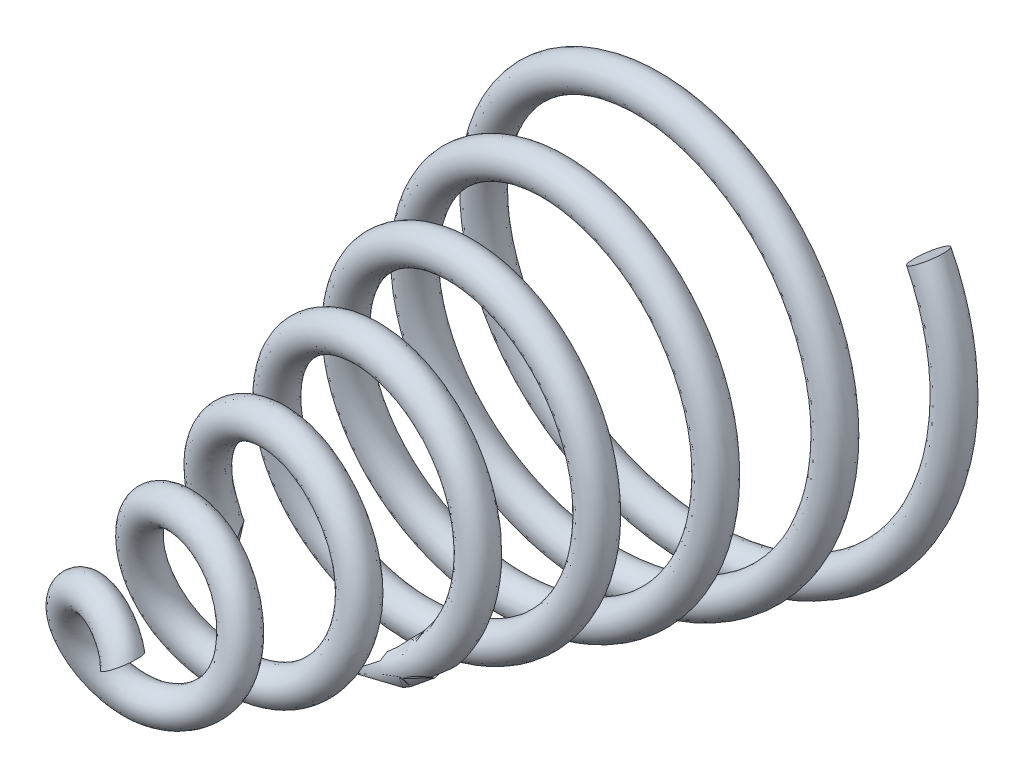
ISO-10303-21;
HEADER;
FILE_DESCRIPTION(('STEP AP214'),'2;1');
FILE_NAME('part.step','',(''),(''),'','','');
FILE_SCHEMA(('AUTOMOTIVE_DESIGN { 1 0 10303 214 1 1 1 1 }'));
ENDSEC;
DATA;
#1=APPLICATION_CONTEXT('core data for automotive mechanical design processes');
#2=APPLICATION_PROTOCOL_DEFINITION('international standard','automotive_design',2000,#1);
#3=PRODUCT_CONTEXT('',#1,'mechanical');
#4=PRODUCT('Part','Part','',(#3));
#5=PRODUCT_RELATED_PRODUCT_CATEGORY('part','',(#4));
#6=PRODUCT_DEFINITION_FORMATION('','',#4);
#7=PRODUCT_DEFINITION_CONTEXT('part definition',#1,'design');
#8=PRODUCT_DEFINITION('design','',#6,#7);
#9=PRODUCT_DEFINITION_SHAPE('','',#8);
#10=(LENGTH_UNIT() NAMED_UNIT(*) SI_UNIT(.MILLI.,.METRE.));
#11=(NAMED_UNIT(*) PLANE_ANGLE_UNIT() SI_UNIT($,.RADIAN.));
#12=(NAMED_UNIT(*) SI_UNIT($,.STERADIAN.) SOLID_ANGLE_UNIT());
#13=UNCERTAINTY_MEASURE_WITH_UNIT(LENGTH_MEASURE(1.E-05),#10,'distance_accuracy_value','');
#14=(GEOMETRIC_REPRESENTATION_CONTEXT(3) GLOBAL_UNCERTAINTY_ASSIGNED_CONTEXT((#13)) GLOBAL_UNIT_ASSIGNED_CONTEXT((#10,
#11,#12)) REPRESENTATION_CONTEXT('',''));
#15=CARTESIAN_POINT('',(0.,0.,0.));
#16=DIRECTION('',(0.,0.,1.));
#17=DIRECTION('',(1.,0.,0.));
#18=AXIS2_PLACEMENT_3D('',#15,#16,#17);
#19=CARTESIAN_POINT('',(1.6245764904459,1.05501388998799,0.0130451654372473));
#20=DIRECTION('',(-0.544639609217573,0.838670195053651,0.));
#21=DIRECTION('',(0.,0.,1.));
#22=AXIS2_PLACEMENT_3D('',#19,#20,#21);
#23=PLANE('',#22);
#24=CARTESIAN_POINT('',(1.6245764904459,1.05501388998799,0.0130451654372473));
#25=DIRECTION('',(-0.544639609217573,0.838670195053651,0.));
#26=DIRECTION('',(0.,0.,1.));
#27=AXIS2_PLACEMENT_3D('',#24,#25,#26);
#28=CIRCLE('',#27,0.15);
#29=CARTESIAN_POINT('',(1.6245764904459,1.05501388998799,0.163045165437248));
#30=VERTEX_POINT('',#29);
#31=EDGE_CURVE('E36',#30,#30,#28,.T.);
#32=ORIENTED_EDGE('',*,*,#31,.T.);
#33=EDGE_LOOP('',(#32));
#34=FACE_BOUND('',#33,.T.);
#35=ADVANCED_FACE('F26',(#34),#23,.T.);
#36=CARTESIAN_POINT('',(0.32119468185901,0.208586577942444,5.81304516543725));
#37=DIRECTION('',(-0.544639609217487,0.838670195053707,0.));
#38=DIRECTION('',(0.,0.,1.));
#39=AXIS2_PLACEMENT_3D('',#36,#37,#38);
#40=PLANE('',#39);
#41=CARTESIAN_POINT('',(0.32119468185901,0.208586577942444,5.81304516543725));
#42=DIRECTION('',(-0.544639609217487,0.838670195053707,0.));
#43=DIRECTION('',(0.,0.,1.));
#44=AXIS2_PLACEMENT_3D('',#41,#42,#43);
#45=CIRCLE('',#44,0.15);
#46=CARTESIAN_POINT('',(0.32119468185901,0.208586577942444,5.96304516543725));
#47=VERTEX_POINT('',#46);
#48=EDGE_CURVE('E11',#47,#47,#45,.T.);
#49=ORIENTED_EDGE('',*,*,#48,.F.);
#50=EDGE_LOOP('',(#49));
#51=FACE_BOUND('',#50,.T.);
#52=ADVANCED_FACE('F44',(#51),#40,.F.);
#53=CARTESIAN_POINT('',(1.6245764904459,1.05501388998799,0.163045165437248));
#54=CARTESIAN_POINT('',(1.8214390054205,0.739416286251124,0.188362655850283));
#55=CARTESIAN_POINT('',(1.92351843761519,0.367983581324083,0.213680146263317));
#56=CARTESIAN_POINT('',(1.90874675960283,-0.433321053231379,0.268810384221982));
#57=CARTESIAN_POINT('',(1.74856908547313,-0.859353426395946,0.298623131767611));
#58=CARTESIAN_POINT('',(1.19918616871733,-1.51573624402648,0.358248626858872));
#59=CARTESIAN_POINT('',(0.812030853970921,-1.74397596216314,0.388061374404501));
#60=CARTESIAN_POINT('',(-0.0170013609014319,-1.90809974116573,0.447686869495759));
#61=CARTESIAN_POINT('',(-0.455993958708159,-1.84363424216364,0.477499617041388));
#62=CARTESIAN_POINT('',(-1.19483408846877,-1.45613953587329,0.53712511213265));
#63=CARTESIAN_POINT('',(-1.49224950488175,-1.13463117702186,0.566937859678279));
#64=CARTESIAN_POINT('',(-1.81995292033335,-0.379192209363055,0.626563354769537));
#65=CARTESIAN_POINT('',(-1.84931667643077,0.0520619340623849,0.656376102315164));
#66=CARTESIAN_POINT('',(-1.63320049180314,0.835418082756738,0.71600159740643));
#67=CARTESIAN_POINT('',(-1.38867093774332,1.18489202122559,0.745814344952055));
#68=CARTESIAN_POINT('',(-0.737568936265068,1.65279111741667,0.805439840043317));
#69=CARTESIAN_POINT('',(-0.333355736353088,1.76978835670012,0.835252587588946));
#70=CARTESIAN_POINT('',(0.456385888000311,1.72600836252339,0.894878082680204));
#71=CARTESIAN_POINT('',(0.83921837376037,1.56559813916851,0.924690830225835));
#72=CARTESIAN_POINT('',(1.41851958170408,1.04310546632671,0.984316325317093));
#73=CARTESIAN_POINT('',(1.61314732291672,0.682975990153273,1.01412907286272));
#74=CARTESIAN_POINT('',(1.73449361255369,-0.0766807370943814,1.07375456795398));
#75=CARTESIAN_POINT('',(1.66101053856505,-0.473568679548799,1.10356731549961));
#76=CARTESIAN_POINT('',(1.28407029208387,-1.13172437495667,1.16319281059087));
#77=CARTESIAN_POINT('',(0.982094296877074,-1.39084299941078,1.1930055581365));
#78=CARTESIAN_POINT('',(0.28564859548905,-1.66268979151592,1.25263105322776));
#79=CARTESIAN_POINT('',(-0.106353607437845,-1.67468798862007,1.28244380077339));
#80=CARTESIAN_POINT('',(-0.808827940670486,-1.45245759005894,1.34206929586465));
#81=CARTESIAN_POINT('',(-1.11695626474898,-1.21919829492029,1.37188204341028));
#82=CARTESIAN_POINT('',(-1.51834653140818,-0.614304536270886,1.43150753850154));
#83=CARTESIAN_POINT('',(-1.61041271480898,-0.244864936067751,1.46132028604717));
#84=CARTESIAN_POINT('',(-1.5442152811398,0.467186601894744,1.52094578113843));
#85=CARTESIAN_POINT('',(-1.38639501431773,0.807376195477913,1.55075852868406));
#86=CARTESIAN_POINT('',(-0.89547355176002,1.31237057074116,1.61038402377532));
#87=CARTESIAN_POINT('',(-0.564212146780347,1.47559444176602,1.64019677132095));
#88=CARTESIAN_POINT('',(0.124178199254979,1.55926320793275,1.69982226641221));
#89=CARTESIAN_POINT('',(0.478919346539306,1.47963669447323,1.72963501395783));
#90=CARTESIAN_POINT('',(1.05812973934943,1.1184021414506,1.7892605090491));
#91=CARTESIAN_POINT('',(1.28072676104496,0.838217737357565,1.81907325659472));
#92=CARTESIAN_POINT('',(1.50130825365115,0.203672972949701,1.87869875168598));
#93=CARTESIAN_POINT('',(1.49874106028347,-0.148438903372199,1.90851149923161));
#94=CARTESIAN_POINT('',(1.27579219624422,-0.770660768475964,1.96813699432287));
#95=CARTESIAN_POINT('',(1.05638001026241,-1.03870898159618,1.9979497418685));
#96=CARTESIAN_POINT('',(0.501490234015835,-1.3774734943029,2.05757523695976));
#97=CARTESIAN_POINT('',(0.168029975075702,-1.44721268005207,2.0873879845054));
#98=CARTESIAN_POINT('',(-0.465825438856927,-1.3640020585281,2.14701347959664));
#99=CARTESIAN_POINT('',(-0.764073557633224,-1.21155317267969,2.17682622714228));
#100=CARTESIAN_POINT('',(-1.19776756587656,-0.756719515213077,2.23645172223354));
#101=CARTESIAN_POINT('',(-1.33188213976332,-0.45604569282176,2.26626446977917));
#102=CARTESIAN_POINT('',(-1.38305016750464,0.159460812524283,2.32588996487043));
#103=CARTESIAN_POINT('',(-1.30014443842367,0.472162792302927,2.35570271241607));
#104=CARTESIAN_POINT('',(-0.959654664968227,0.974427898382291,2.41532820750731));
#105=CARTESIAN_POINT('',(-0.703419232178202,1.16238872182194,2.44514095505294));
#106=CARTESIAN_POINT('',(-0.133431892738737,1.33642858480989,2.50476645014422));
#107=CARTESIAN_POINT('',(0.178299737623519,1.32211784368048,2.53457919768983));
#108=CARTESIAN_POINT('',(0.721176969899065,1.10379127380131,2.5942046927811));
#109=CARTESIAN_POINT('',(0.950539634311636,0.900726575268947,2.62401744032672));
#110=CARTESIAN_POINT('',(1.23074343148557,0.399418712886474,2.68364293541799));
#111=CARTESIAN_POINT('',(1.28081195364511,0.103002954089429,2.71345568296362));
#112=CARTESIAN_POINT('',(1.18599696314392,-0.45243402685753,2.77308117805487));
#113=CARTESIAN_POINT('',(1.0416531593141,-0.70958425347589,2.8028939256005));
#114=CARTESIAN_POINT('',(0.627249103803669,-1.07520783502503,2.86251942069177));
#115=CARTESIAN_POINT('',(0.35875590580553,-1.18258822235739,2.89233216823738));
#116=CARTESIAN_POINT('',(-0.182525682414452,-1.20649617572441,2.95195766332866));
#117=CARTESIAN_POINT('',(-0.453445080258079,-1.12315857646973,2.98177041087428));
#118=CARTESIAN_POINT('',(-0.881019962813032,-0.808328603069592,3.04139590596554));
#119=CARTESIAN_POINT('',(-1.03633520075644,-0.578092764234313,3.07120865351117));
#120=CARTESIAN_POINT('',(-1.1686774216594,-0.0750625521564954,3.13083414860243));
#121=CARTESIAN_POINT('',(-1.14545966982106,0.195948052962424,3.16064689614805));
#122=CARTESIAN_POINT('',(-0.937028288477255,0.660663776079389,3.22027239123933));
#123=CARTESIAN_POINT('',(-0.752729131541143,0.8528606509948,3.25008513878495));
#124=CARTESIAN_POINT('',(-0.308355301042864,1.07874015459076,3.30971063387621));
#125=CARTESIAN_POINT('',(-0.049906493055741,1.1118399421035,3.33952338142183));
#126=CARTESIAN_POINT('',(0.427173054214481,1.0108207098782,3.3991488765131));
#127=CARTESIAN_POINT('',(0.644208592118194,0.877261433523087,3.42896162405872));
#128=CARTESIAN_POINT('',(0.94520650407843,0.507443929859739,3.48858711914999));
#129=CARTESIAN_POINT('',(1.0283022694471,0.272594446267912,3.51839986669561));
#130=CARTESIAN_POINT('',(1.03024164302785,-0.193399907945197,3.57802536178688));
#131=CARTESIAN_POINT('',(0.949295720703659,-0.42294115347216,3.60783810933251));
#132=CARTESIAN_POINT('',(0.664904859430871,-0.778329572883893,3.66746360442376));
#133=CARTESIAN_POINT('',(0.462607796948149,-0.903089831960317,3.69727635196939));
#134=CARTESIAN_POINT('',(0.0286725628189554,-0.998686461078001,3.75690184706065));
#135=CARTESIAN_POINT('',(-0.201425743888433,-0.969405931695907,3.78671459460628));
#136=CARTESIAN_POINT('',(-0.589434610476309,-0.776062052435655,3.84634008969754));
#137=CARTESIAN_POINT('',(-0.746106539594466,-0.612858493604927,3.87615283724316));
#138=CARTESIAN_POINT('',(-0.922058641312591,-0.228537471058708,3.93577833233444));
#139=CARTESIAN_POINT('',(-0.940930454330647,-0.0088335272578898,3.96559107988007));
#140=CARTESIAN_POINT('',(-0.839085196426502,0.39023189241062,4.02521657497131));
#141=CARTESIAN_POINT('',(-0.718929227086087,0.568272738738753,4.05502932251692));
#142=CARTESIAN_POINT('',(-0.397660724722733,0.808295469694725,4.11465481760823));
#143=CARTESIAN_POINT('',(-0.197784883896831,0.869624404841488,4.14446756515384));
#144=CARTESIAN_POINT('',(0.387103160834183,0.847574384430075,4.23390580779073));
#145=CARTESIAN_POINT('',(0.731243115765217,0.538792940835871,4.29353130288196));
#146=CARTESIAN_POINT('',(0.85904049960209,-0.18714461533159,4.41278229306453));
#147=CARTESIAN_POINT('',(0.642259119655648,-0.565447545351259,4.47240778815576));
#148=CARTESIAN_POINT('',(-0.000520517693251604,-0.826589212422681,4.59165877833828));
#149=CARTESIAN_POINT('',(-0.390680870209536,-0.701671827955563,4.65128427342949));
#150=CARTESIAN_POINT('',(-0.756469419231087,-0.163750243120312,4.77053526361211));
#151=CARTESIAN_POINT('',(-0.718243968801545,0.217672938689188,4.83016075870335));
#152=CARTESIAN_POINT('',(-0.298696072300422,0.656646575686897,4.94941174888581));
#153=CARTESIAN_POINT('',(0.0561741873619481,0.695640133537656,5.00903724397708));
#154=CARTESIAN_POINT('',(0.536220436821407,0.399686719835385,5.12828823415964));
#155=CARTESIAN_POINT('',(0.639606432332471,0.0855744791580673,5.1879137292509));
#156=CARTESIAN_POINT('',(0.464574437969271,-0.404801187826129,5.30716471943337));
#157=CARTESIAN_POINT('',(0.20125773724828,-0.557491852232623,5.36679021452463));
#158=CARTESIAN_POINT('',(-0.271882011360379,-0.493679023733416,5.4860412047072));
#159=CARTESIAN_POINT('',(-0.457692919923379,-0.286767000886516,5.54566669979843));
#160=CARTESIAN_POINT('',(-0.489622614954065,0.14624539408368,5.66491768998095));
#161=CARTESIAN_POINT('',(-0.340334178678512,0.349057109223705,5.72454318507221));
#162=CARTESIAN_POINT('',(0.0354376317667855,0.457028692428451,5.84379417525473));
#163=CARTESIAN_POINT('',(0.240280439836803,0.36251931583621,5.90341967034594));
#164=CARTESIAN_POINT('',(0.32119468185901,0.208586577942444,5.96304516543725));
#165=CARTESIAN_POINT('',(1.876177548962,1.21840577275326,0.163045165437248));
#166=CARTESIAN_POINT('',(2.10440968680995,0.854503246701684,0.188362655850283));
#167=CARTESIAN_POINT('',(2.22351843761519,0.425578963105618,0.213680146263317));
#168=CARTESIAN_POINT('',(2.20874675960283,-0.501142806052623,0.268810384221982));
#169=CARTESIAN_POINT('',(2.0247276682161,-0.994764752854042,0.298623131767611));
#170=CARTESIAN_POINT('',(1.39024051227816,-1.75677156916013,0.358248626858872));
#171=CARTESIAN_POINT('',(0.9421137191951,-2.02268412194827,0.388061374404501));
#172=CARTESIAN_POINT('',(-0.0194578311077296,-2.21566072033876,0.447686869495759));
#173=CARTESIAN_POINT('',(-0.52956455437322,-2.14227643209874,0.477499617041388));
#174=CARTESIAN_POINT('',(-1.38971408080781,-1.69409242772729,0.53712511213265));
#175=CARTESIAN_POINT('',(-1.73690948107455,-1.32102132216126,0.566937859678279));
#176=CARTESIAN_POINT('',(-2.12099795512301,-0.442213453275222,0.626563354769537));
#177=CARTESIAN_POINT('',(-2.15677375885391,0.0604245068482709,0.656376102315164));
#178=CARTESIAN_POINT('',(-1.90716093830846,0.975223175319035,0.71600159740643));
#179=CARTESIAN_POINT('',(-1.62283737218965,1.38430584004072,0.745814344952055));
#180=CARTESIAN_POINT('',(-0.863183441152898,1.93354151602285,0.805439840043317));
#181=CARTESIAN_POINT('',(-0.390583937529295,2.07198816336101,0.835252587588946));
#182=CARTESIAN_POINT('',(0.534717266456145,2.02343732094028,0.894878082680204));
#183=CARTESIAN_POINT('',(0.984258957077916,1.83682317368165,0.924690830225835));
#184=CARTESIAN_POINT('',(1.66612552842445,1.22556391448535,0.984316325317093));
#185=CARTESIAN_POINT('',(1.8962583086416,0.80317565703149,1.01412907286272));
#186=CARTESIAN_POINT('',(2.04177789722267,-0.0899532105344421,1.07375456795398));
#187=CARTESIAN_POINT('',(1.95688032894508,-0.557597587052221,1.10356731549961));
#188=CARTESIAN_POINT('',(1.51502164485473,-1.33485306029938,1.16319281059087));
#189=CARTESIAN_POINT('',(1.15976394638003,-1.64190730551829,1.1930055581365));
#190=CARTESIAN_POINT('',(0.338042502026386,-1.9657651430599,1.25263105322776));
#191=CARTESIAN_POINT('',(-0.125524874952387,-1.98166071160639,1.28244380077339));
#192=CARTESIAN_POINT('',(-0.958182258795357,-1.72133131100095,1.34206929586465));
#193=CARTESIAN_POINT('',(-1.32448279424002,-1.44620606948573,1.37188204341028));
#194=CARTESIAN_POINT('',(-1.80334133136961,-0.729966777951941,1.43150753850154));
#195=CARTESIAN_POINT('',(-1.91443837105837,-0.291428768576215,1.46132028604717));
#196=CARTESIAN_POINT('',(-1.8387051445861,0.555930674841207,1.52094578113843));
#197=CARTESIAN_POINT('',(-1.65235087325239,0.961866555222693,1.55075852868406));
#198=CARTESIAN_POINT('',(-1.0691103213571,1.56624073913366,1.61038402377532));
#199=CARTESIAN_POINT('',(-0.674379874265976,1.76275791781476,1.64019677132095));
#200=CARTESIAN_POINT('',(0.148250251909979,1.8658905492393,1.69982226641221));
#201=CARTESIAN_POINT('',(0.57330258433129,1.7723679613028,1.72963501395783));
#202=CARTESIAN_POINT('',(1.26925575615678,1.34206616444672,1.7892605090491));
#203=CARTESIAN_POINT('',(1.53788471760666,1.00694703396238,1.81907325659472));
#204=CARTESIAN_POINT('',(1.80603888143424,0.245374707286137,1.87869875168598));
#205=CARTESIAN_POINT('',(1.80484956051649,-0.178395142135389,1.90851149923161));
#206=CARTESIAN_POINT('',(1.53924647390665,-0.929379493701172,1.96813699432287));
#207=CARTESIAN_POINT('',(1.27594821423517,-1.254091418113,1.9979497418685));
#208=CARTESIAN_POINT('',(0.607057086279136,-1.66636002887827,2.05757523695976));
#209=CARTESIAN_POINT('',(0.203871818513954,-1.75268796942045,2.0873879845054));
#210=CARTESIAN_POINT('',(-0.564872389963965,-1.65518841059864,2.14701347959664));
#211=CARTESIAN_POINT('',(-0.92782251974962,-1.4719107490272,2.17682622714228));
#212=CARTESIAN_POINT('',(-1.45758780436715,-0.921319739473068,2.23645172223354));
#213=CARTESIAN_POINT('',(-1.62274275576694,-0.556045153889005,2.26626446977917));
#214=CARTESIAN_POINT('',(-1.68864112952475,0.194302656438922,2.32588996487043));
#215=CARTESIAN_POINT('',(-1.58937494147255,0.576783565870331,2.35570271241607));
#216=CARTESIAN_POINT('',(-1.17575458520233,1.19328998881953,2.41532820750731));
#217=CARTESIAN_POINT('',(-0.862999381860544,1.42532210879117,2.44514095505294));
#218=CARTESIAN_POINT('',(-0.164389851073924,1.64243739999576,2.50476645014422));
#219=CARTESIAN_POINT('',(0.219003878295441,1.62698332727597,2.53457919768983));
#220=CARTESIAN_POINT('',(0.889063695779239,1.36150009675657,2.5942046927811));
#221=CARTESIAN_POINT('',(1.17351145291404,1.11258350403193,2.62401744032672));
#222=CARTESIAN_POINT('',(1.52316421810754,0.49475954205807,2.68364293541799));
#223=CARTESIAN_POINT('',(1.58735886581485,0.128078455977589,2.71345568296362));
#224=CARTESIAN_POINT('',(1.47351947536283,-0.561661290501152,2.77308117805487));
#225=CARTESIAN_POINT('',(1.29609027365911,-0.882389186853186,2.8028939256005));
#226=CARTESIAN_POINT('',(0.782609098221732,-1.34065662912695,2.86251942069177));
#227=CARTESIAN_POINT('',(0.448463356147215,-1.47678605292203,2.89233216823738));
#228=CARTESIAN_POINT('',(-0.228094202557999,-1.51067260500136,2.95195766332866));
#229=CARTESIAN_POINT('',(-0.568173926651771,-1.4085304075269,2.98177041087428));
#230=CARTESIAN_POINT('',(-1.10734729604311,-1.01659700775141,3.04139590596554));
#231=CARTESIAN_POINT('',(-1.30471865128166,-0.728326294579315,3.07120865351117));
#232=CARTESIAN_POINT('',(-1.47558575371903,-0.0952384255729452,3.13083414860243));
#233=CARTESIAN_POINT('',(-1.44870488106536,0.247349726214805,3.16064689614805));
#234=CARTESIAN_POINT('',(-1.1886727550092,0.837510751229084,3.22027239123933));
#235=CARTESIAN_POINT('',(-0.956612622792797,1.08314593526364,3.25008513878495));
#236=CARTESIAN_POINT('',(-0.393352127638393,1.37433333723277,3.30971063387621));
#237=CARTESIAN_POINT('',(-0.0641846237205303,1.41907914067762,3.33952338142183));
#238=CARTESIAN_POINT('',(0.546445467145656,1.29432358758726,3.3991488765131));
#239=CARTESIAN_POINT('',(0.825855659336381,1.12546323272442,3.42896162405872));
#240=CARTESIAN_POINT('',(1.21595537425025,0.653371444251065,3.48858711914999));
#241=CARTESIAN_POINT('',(1.3254732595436,0.351898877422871,3.51839986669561));
#242=CARTESIAN_POINT('',(1.33262713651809,-0.249638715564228,3.57802536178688));
#243=CARTESIAN_POINT('',(1.23045574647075,-0.547636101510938,3.60783810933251));
#244=CARTESIAN_POINT('',(0.865084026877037,-1.01184208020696,3.66746360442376));
#245=CARTESIAN_POINT('',(0.603308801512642,-1.17659123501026,3.6972763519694));
#246=CARTESIAN_POINT('',(0.0380413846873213,-1.30611452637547,3.75690184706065));
#247=CARTESIAN_POINT('',(-0.263461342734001,-1.270655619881,3.78671459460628));
#248=CARTESIAN_POINT('',(-0.775022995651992,-1.02133076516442,3.84634008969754));
#249=CARTESIAN_POINT('',(-0.983420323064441,-0.808516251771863,3.87615283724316));
#250=CARTESIAN_POINT('',(-1.22045843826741,-0.30308511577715,3.93577833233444));
#251=CARTESIAN_POINT('',(-1.24848174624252,-0.0122966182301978,3.96559107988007));
#252=CARTESIAN_POINT('',(-1.11821761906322,0.519401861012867,4.02521657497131));
#253=CARTESIAN_POINT('',(-0.960588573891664,0.758537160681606,4.05502932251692));
#254=CARTESIAN_POINT('',(-0.533975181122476,1.08400937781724,4.11465481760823));
#255=CARTESIAN_POINT('',(-0.266588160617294,1.1694008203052,4.14446756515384));
#256=CARTESIAN_POINT('',(0.521764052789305,1.14801673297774,4.23390580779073));
#257=CARTESIAN_POINT('',(0.994880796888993,0.736009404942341,4.29353130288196));
#258=CARTESIAN_POINT('',(1.1812511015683,-0.254816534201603,4.41278229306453));
#259=CARTESIAN_POINT('',(0.891040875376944,-0.78110189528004,4.47240778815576));
#260=CARTESIAN_POINT('',(0.00189384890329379,-1.15582063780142,4.59165877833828));
#261=CARTESIAN_POINT('',(-0.548481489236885,-0.990632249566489,4.65128427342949));
#262=CARTESIAN_POINT('',(-1.07765289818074,-0.236140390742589,4.77053526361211));
#263=CARTESIAN_POINT('',(-1.03415747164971,0.310397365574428,4.83016075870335));
#264=CARTESIAN_POINT('',(-0.437748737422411,0.955081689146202,4.94941174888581));
#265=CARTESIAN_POINT('',(0.0795784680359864,1.02404750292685,5.00903724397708));
#266=CARTESIAN_POINT('',(0.798247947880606,0.599037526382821,5.12828823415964));
#267=CARTESIAN_POINT('',(0.965476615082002,0.132561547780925,5.1879137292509));
#268=CARTESIAN_POINT('',(0.715099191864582,-0.618428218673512,5.30716471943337));
#269=CARTESIAN_POINT('',(0.316485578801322,-0.86590992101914,5.36679021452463));
#270=CARTESIAN_POINT('',(-0.427330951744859,-0.783911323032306,5.4860412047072));
#271=CARTESIAN_POINT('',(-0.734542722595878,-0.464961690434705,5.54566669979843));
#272=CARTESIAN_POINT('',(-0.806278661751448,0.236401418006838,5.66491768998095));
#273=CARTESIAN_POINT('',(-0.5733398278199,0.581667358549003,5.72454318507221));
#274=CARTESIAN_POINT('',(0.0561743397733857,0.78561528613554,5.84379417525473));
#275=CARTESIAN_POINT('',(0.418002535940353,0.639674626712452,5.90341967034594));
#276=CARTESIAN_POINT('',(0.572795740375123,0.371978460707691,5.96304516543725));
#277=CARTESIAN_POINT('',(1.876177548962,1.21840577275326,-0.136954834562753));
#278=CARTESIAN_POINT('',(2.10440968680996,0.854503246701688,-0.111637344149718));
#279=CARTESIAN_POINT('',(2.22351843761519,0.425578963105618,-0.0863198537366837));
#280=CARTESIAN_POINT('',(2.20874675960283,-0.501142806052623,-0.0311896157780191));
#281=CARTESIAN_POINT('',(2.0247276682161,-0.994764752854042,-0.00137686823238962));
#282=CARTESIAN_POINT('',(1.39024051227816,-1.75677156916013,0.0582486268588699));
#283=CARTESIAN_POINT('',(0.9421137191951,-2.02268412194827,0.0880613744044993));
#284=CARTESIAN_POINT('',(-0.019457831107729,-2.21566072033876,0.147686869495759));
#285=CARTESIAN_POINT('',(-0.52956455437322,-2.14227643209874,0.177499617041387));
#286=CARTESIAN_POINT('',(-1.38971408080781,-1.69409242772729,0.237125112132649));
#287=CARTESIAN_POINT('',(-1.73690948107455,-1.32102132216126,0.266937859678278));
#288=CARTESIAN_POINT('',(-2.12099795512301,-0.442213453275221,0.326563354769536));
#289=CARTESIAN_POINT('',(-2.15677375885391,0.0604245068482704,0.356376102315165));
#290=CARTESIAN_POINT('',(-1.90716093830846,0.975223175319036,0.416001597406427));
#291=CARTESIAN_POINT('',(-1.62283737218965,1.38430584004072,0.445814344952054));
#292=CARTESIAN_POINT('',(-0.863183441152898,1.93354151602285,0.505439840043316));
#293=CARTESIAN_POINT('',(-0.390583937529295,2.07198816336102,0.535252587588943));
#294=CARTESIAN_POINT('',(0.534717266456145,2.02343732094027,0.594878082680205));
#295=CARTESIAN_POINT('',(0.984258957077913,1.83682317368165,0.624690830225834));
#296=CARTESIAN_POINT('',(1.66612552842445,1.22556391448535,0.684316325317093));
#297=CARTESIAN_POINT('',(1.8962583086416,0.803175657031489,0.714129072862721));
#298=CARTESIAN_POINT('',(2.04177789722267,-0.0899532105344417,0.773754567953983));
#299=CARTESIAN_POINT('',(1.95688032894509,-0.557597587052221,0.80356731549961));
#300=CARTESIAN_POINT('',(1.51502164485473,-1.33485306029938,0.863192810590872));
#301=CARTESIAN_POINT('',(1.15976394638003,-1.64190730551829,0.893005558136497));
#302=CARTESIAN_POINT('',(0.338042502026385,-1.9657651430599,0.952631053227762));
#303=CARTESIAN_POINT('',(-0.125524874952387,-1.98166071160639,0.982443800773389));
#304=CARTESIAN_POINT('',(-0.958182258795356,-1.72133131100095,1.04206929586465));
#305=CARTESIAN_POINT('',(-1.32448279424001,-1.44620606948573,1.07188204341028));
#306=CARTESIAN_POINT('',(-1.80334133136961,-0.729966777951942,1.13150753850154));
#307=CARTESIAN_POINT('',(-1.91443837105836,-0.291428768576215,1.16132028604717));
#308=CARTESIAN_POINT('',(-1.8387051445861,0.555930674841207,1.22094578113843));
#309=CARTESIAN_POINT('',(-1.65235087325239,0.961866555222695,1.25075852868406));
#310=CARTESIAN_POINT('',(-1.0691103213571,1.56624073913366,1.31038402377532));
#311=CARTESIAN_POINT('',(-0.674379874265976,1.76275791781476,1.34019677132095));
#312=CARTESIAN_POINT('',(0.148250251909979,1.8658905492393,1.3998222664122));
#313=CARTESIAN_POINT('',(0.573302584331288,1.7723679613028,1.42963501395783));
#314=CARTESIAN_POINT('',(1.26925575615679,1.34206616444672,1.4892605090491));
#315=CARTESIAN_POINT('',(1.53788471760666,1.00694703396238,1.51907325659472));
#316=CARTESIAN_POINT('',(1.80603888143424,0.245374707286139,1.57869875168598));
#317=CARTESIAN_POINT('',(1.80484956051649,-0.178395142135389,1.60851149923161));
#318=CARTESIAN_POINT('',(1.53924647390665,-0.929379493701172,1.66813699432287));
#319=CARTESIAN_POINT('',(1.27594821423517,-1.254091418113,1.6979497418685));
#320=CARTESIAN_POINT('',(0.607057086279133,-1.66636002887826,1.75757523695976));
#321=CARTESIAN_POINT('',(0.203871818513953,-1.75268796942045,1.7873879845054));
#322=CARTESIAN_POINT('',(-0.564872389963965,-1.65518841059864,1.84701347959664));
#323=CARTESIAN_POINT('',(-0.927822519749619,-1.4719107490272,1.87682622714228));
#324=CARTESIAN_POINT('',(-1.45758780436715,-0.921319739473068,1.93645172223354));
#325=CARTESIAN_POINT('',(-1.62274275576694,-0.556045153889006,1.96626446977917));
#326=CARTESIAN_POINT('',(-1.68864112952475,0.194302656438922,2.02588996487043));
#327=CARTESIAN_POINT('',(-1.58937494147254,0.576783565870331,2.05570271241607));
#328=CARTESIAN_POINT('',(-1.17575458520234,1.19328998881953,2.11532820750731));
#329=CARTESIAN_POINT('',(-0.862999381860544,1.42532210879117,2.14514095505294));
#330=CARTESIAN_POINT('',(-0.164389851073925,1.64243739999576,2.20476645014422));
#331=CARTESIAN_POINT('',(0.219003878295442,1.62698332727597,2.23457919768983));
#332=CARTESIAN_POINT('',(0.889063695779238,1.36150009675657,2.2942046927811));
#333=CARTESIAN_POINT('',(1.17351145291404,1.11258350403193,2.32401744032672));
#334=CARTESIAN_POINT('',(1.52316421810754,0.49475954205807,2.38364293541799));
#335=CARTESIAN_POINT('',(1.58735886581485,0.12807845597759,2.41345568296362));
#336=CARTESIAN_POINT('',(1.47351947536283,-0.561661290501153,2.47308117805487));
#337=CARTESIAN_POINT('',(1.2960902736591,-0.882389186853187,2.5028939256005));
#338=CARTESIAN_POINT('',(0.782609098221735,-1.34065662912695,2.56251942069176));
#339=CARTESIAN_POINT('',(0.448463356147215,-1.47678605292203,2.59233216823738));
#340=CARTESIAN_POINT('',(-0.228094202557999,-1.51067260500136,2.65195766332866));
#341=CARTESIAN_POINT('',(-0.56817392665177,-1.4085304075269,2.68177041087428));
#342=CARTESIAN_POINT('',(-1.10734729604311,-1.01659700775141,2.74139590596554));
#343=CARTESIAN_POINT('',(-1.30471865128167,-0.728326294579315,2.77120865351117));
#344=CARTESIAN_POINT('',(-1.47558575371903,-0.0952384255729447,2.83083414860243));
#345=CARTESIAN_POINT('',(-1.44870488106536,0.247349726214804,2.86064689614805));
#346=CARTESIAN_POINT('',(-1.18867275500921,0.837510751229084,2.92027239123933));
#347=CARTESIAN_POINT('',(-0.956612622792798,1.08314593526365,2.95008513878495));
#348=CARTESIAN_POINT('',(-0.393352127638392,1.37433333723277,3.00971063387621));
#349=CARTESIAN_POINT('',(-0.0641846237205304,1.41907914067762,3.03952338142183));
#350=CARTESIAN_POINT('',(0.546445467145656,1.29432358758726,3.0991488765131));
#351=CARTESIAN_POINT('',(0.825855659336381,1.12546323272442,3.12896162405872));
#352=CARTESIAN_POINT('',(1.21595537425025,0.653371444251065,3.18858711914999));
#353=CARTESIAN_POINT('',(1.3254732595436,0.351898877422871,3.21839986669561));
#354=CARTESIAN_POINT('',(1.33262713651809,-0.249638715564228,3.27802536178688));
#355=CARTESIAN_POINT('',(1.23045574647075,-0.547636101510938,3.30783810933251));
#356=CARTESIAN_POINT('',(0.865084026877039,-1.01184208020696,3.36746360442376));
#357=CARTESIAN_POINT('',(0.603308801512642,-1.17659123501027,3.39727635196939));
#358=CARTESIAN_POINT('',(0.0380413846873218,-1.30611452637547,3.45690184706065));
#359=CARTESIAN_POINT('',(-0.263461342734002,-1.270655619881,3.48671459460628));
#360=CARTESIAN_POINT('',(-0.775022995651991,-1.02133076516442,3.54634008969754));
#361=CARTESIAN_POINT('',(-0.983420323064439,-0.808516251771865,3.57615283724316));
#362=CARTESIAN_POINT('',(-1.22045843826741,-0.303085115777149,3.63577833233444));
#363=CARTESIAN_POINT('',(-1.24848174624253,-0.012296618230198,3.66559107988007));
#364=CARTESIAN_POINT('',(-1.11821761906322,0.519401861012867,3.72521657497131));
#365=CARTESIAN_POINT('',(-0.960588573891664,0.758537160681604,3.75502932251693));
#366=CARTESIAN_POINT('',(-0.533975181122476,1.08400937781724,3.81465481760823));
#367=CARTESIAN_POINT('',(-0.266588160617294,1.1694008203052,3.84446756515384));
#368=CARTESIAN_POINT('',(0.521764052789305,1.14801673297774,3.93390580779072));
#369=CARTESIAN_POINT('',(0.994880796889,0.736009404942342,3.99353130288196));
#370=CARTESIAN_POINT('',(1.18125110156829,-0.254816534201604,4.11278229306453));
#371=CARTESIAN_POINT('',(0.891040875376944,-0.78110189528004,4.17240778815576));
#372=CARTESIAN_POINT('',(0.00189384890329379,-1.15582063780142,4.29165877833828));
#373=CARTESIAN_POINT('',(-0.548481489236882,-0.99063224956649,4.35128427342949));
#374=CARTESIAN_POINT('',(-1.07765289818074,-0.236140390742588,4.47053526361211));
#375=CARTESIAN_POINT('',(-1.03415747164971,0.310397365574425,4.53016075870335));
#376=CARTESIAN_POINT('',(-0.437748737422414,0.955081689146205,4.64941174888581));
#377=CARTESIAN_POINT('',(0.0795784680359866,1.02404750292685,4.70903724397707));
#378=CARTESIAN_POINT('',(0.798247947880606,0.599037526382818,4.82828823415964));
#379=CARTESIAN_POINT('',(0.965476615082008,0.132561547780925,4.8879137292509));
#380=CARTESIAN_POINT('',(0.715099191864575,-0.618428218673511,5.00716471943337));
#381=CARTESIAN_POINT('',(0.316485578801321,-0.865909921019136,5.06679021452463));
#382=CARTESIAN_POINT('',(-0.427330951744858,-0.783911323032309,5.1860412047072));
#383=CARTESIAN_POINT('',(-0.734542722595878,-0.464961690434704,5.24566669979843));
#384=CARTESIAN_POINT('',(-0.806278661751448,0.236401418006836,5.36491768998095));
#385=CARTESIAN_POINT('',(-0.5733398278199,0.581667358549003,5.42454318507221));
#386=CARTESIAN_POINT('',(0.0561743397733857,0.78561528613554,5.54379417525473));
#387=CARTESIAN_POINT('',(0.418002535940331,0.639674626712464,5.60341967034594));
#388=CARTESIAN_POINT('',(0.572795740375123,0.371978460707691,5.66304516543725));
#389=CARTESIAN_POINT('',(1.6245764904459,1.05501388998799,-0.136954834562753));
#390=CARTESIAN_POINT('',(1.8214390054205,0.739416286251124,-0.111637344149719));
#391=CARTESIAN_POINT('',(1.92351843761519,0.367983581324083,-0.0863198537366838));
#392=CARTESIAN_POINT('',(1.90874675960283,-0.433321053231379,-0.031189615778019));
#393=CARTESIAN_POINT('',(1.74856908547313,-0.859353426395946,-0.00137686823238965));
#394=CARTESIAN_POINT('',(1.19918616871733,-1.51573624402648,0.0582486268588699));
#395=CARTESIAN_POINT('',(0.812030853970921,-1.74397596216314,0.0880613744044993));
#396=CARTESIAN_POINT('',(-0.0170013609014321,-1.90809974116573,0.147686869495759));
#397=CARTESIAN_POINT('',(-0.455993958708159,-1.84363424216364,0.177499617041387));
#398=CARTESIAN_POINT('',(-1.19483408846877,-1.45613953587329,0.237125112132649));
#399=CARTESIAN_POINT('',(-1.49224950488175,-1.13463117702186,0.266937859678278));
#400=CARTESIAN_POINT('',(-1.81995292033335,-0.379192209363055,0.326563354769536));
#401=CARTESIAN_POINT('',(-1.84931667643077,0.0520619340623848,0.356376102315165));
#402=CARTESIAN_POINT('',(-1.63320049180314,0.835418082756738,0.416001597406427));
#403=CARTESIAN_POINT('',(-1.38867093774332,1.18489202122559,0.445814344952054));
#404=CARTESIAN_POINT('',(-0.737568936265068,1.65279111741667,0.505439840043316));
#405=CARTESIAN_POINT('',(-0.333355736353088,1.76978835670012,0.535252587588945));
#406=CARTESIAN_POINT('',(0.456385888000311,1.72600836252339,0.594878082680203));
#407=CARTESIAN_POINT('',(0.83921837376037,1.56559813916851,0.624690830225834));
#408=CARTESIAN_POINT('',(1.41851958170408,1.04310546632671,0.684316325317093));
#409=CARTESIAN_POINT('',(1.61314732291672,0.682975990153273,0.714129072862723));
#410=CARTESIAN_POINT('',(1.73449361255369,-0.0766807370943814,0.773754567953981));
#411=CARTESIAN_POINT('',(1.66101053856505,-0.473568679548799,0.803567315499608));
#412=CARTESIAN_POINT('',(1.28407029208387,-1.13172437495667,0.863192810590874));
#413=CARTESIAN_POINT('',(0.982094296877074,-1.39084299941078,0.893005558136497));
#414=CARTESIAN_POINT('',(0.28564859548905,-1.66268979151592,0.952631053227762));
#415=CARTESIAN_POINT('',(-0.106353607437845,-1.67468798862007,0.982443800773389));
#416=CARTESIAN_POINT('',(-0.808827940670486,-1.45245759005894,1.04206929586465));
#417=CARTESIAN_POINT('',(-1.11695626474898,-1.21919829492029,1.07188204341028));
#418=CARTESIAN_POINT('',(-1.51834653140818,-0.614304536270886,1.13150753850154));
#419=CARTESIAN_POINT('',(-1.61041271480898,-0.244864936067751,1.16132028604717));
#420=CARTESIAN_POINT('',(-1.5442152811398,0.467186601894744,1.22094578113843));
#421=CARTESIAN_POINT('',(-1.38639501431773,0.807376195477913,1.25075852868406));
#422=CARTESIAN_POINT('',(-0.89547355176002,1.31237057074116,1.31038402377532));
#423=CARTESIAN_POINT('',(-0.564212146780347,1.47559444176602,1.34019677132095));
#424=CARTESIAN_POINT('',(0.124178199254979,1.55926320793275,1.3998222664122));
#425=CARTESIAN_POINT('',(0.478919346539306,1.47963669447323,1.42963501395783));
#426=CARTESIAN_POINT('',(1.05812973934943,1.1184021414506,1.4892605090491));
#427=CARTESIAN_POINT('',(1.28072676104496,0.838217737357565,1.51907325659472));
#428=CARTESIAN_POINT('',(1.50130825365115,0.203672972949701,1.57869875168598));
#429=CARTESIAN_POINT('',(1.49874106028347,-0.148438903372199,1.60851149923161));
#430=CARTESIAN_POINT('',(1.27579219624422,-0.770660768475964,1.66813699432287));
#431=CARTESIAN_POINT('',(1.05638001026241,-1.03870898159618,1.6979497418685));
#432=CARTESIAN_POINT('',(0.501490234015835,-1.3774734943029,1.75757523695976));
#433=CARTESIAN_POINT('',(0.168029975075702,-1.44721268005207,1.7873879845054));
#434=CARTESIAN_POINT('',(-0.465825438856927,-1.3640020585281,1.84701347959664));
#435=CARTESIAN_POINT('',(-0.764073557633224,-1.21155317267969,1.87682622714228));
#436=CARTESIAN_POINT('',(-1.19776756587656,-0.756719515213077,1.93645172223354));
#437=CARTESIAN_POINT('',(-1.33188213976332,-0.45604569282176,1.96626446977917));
#438=CARTESIAN_POINT('',(-1.38305016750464,0.159460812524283,2.02588996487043));
#439=CARTESIAN_POINT('',(-1.30014443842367,0.472162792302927,2.05570271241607));
#440=CARTESIAN_POINT('',(-0.959654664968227,0.974427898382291,2.11532820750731));
#441=CARTESIAN_POINT('',(-0.703419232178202,1.16238872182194,2.14514095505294));
#442=CARTESIAN_POINT('',(-0.133431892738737,1.33642858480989,2.20476645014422));
#443=CARTESIAN_POINT('',(0.178299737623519,1.32211784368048,2.23457919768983));
#444=CARTESIAN_POINT('',(0.721176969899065,1.10379127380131,2.2942046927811));
#445=CARTESIAN_POINT('',(0.950539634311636,0.900726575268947,2.32401744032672));
#446=CARTESIAN_POINT('',(1.23074343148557,0.399418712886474,2.38364293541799));
#447=CARTESIAN_POINT('',(1.28081195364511,0.103002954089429,2.41345568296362));
#448=CARTESIAN_POINT('',(1.18599696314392,-0.45243402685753,2.47308117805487));
#449=CARTESIAN_POINT('',(1.0416531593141,-0.70958425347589,2.5028939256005));
#450=CARTESIAN_POINT('',(0.627249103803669,-1.07520783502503,2.56251942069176));
#451=CARTESIAN_POINT('',(0.35875590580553,-1.18258822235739,2.59233216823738));
#452=CARTESIAN_POINT('',(-0.182525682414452,-1.20649617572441,2.65195766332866));
#453=CARTESIAN_POINT('',(-0.453445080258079,-1.12315857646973,2.68177041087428));
#454=CARTESIAN_POINT('',(-0.881019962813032,-0.808328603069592,2.74139590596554));
#455=CARTESIAN_POINT('',(-1.03633520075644,-0.578092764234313,2.77120865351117));
#456=CARTESIAN_POINT('',(-1.1686774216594,-0.0750625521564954,2.83083414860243));
#457=CARTESIAN_POINT('',(-1.14545966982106,0.195948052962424,2.86064689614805));
#458=CARTESIAN_POINT('',(-0.937028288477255,0.660663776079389,2.92027239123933));
#459=CARTESIAN_POINT('',(-0.752729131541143,0.8528606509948,2.95008513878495));
#460=CARTESIAN_POINT('',(-0.308355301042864,1.07874015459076,3.00971063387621));
#461=CARTESIAN_POINT('',(-0.049906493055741,1.1118399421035,3.03952338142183));
#462=CARTESIAN_POINT('',(0.427173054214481,1.0108207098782,3.0991488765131));
#463=CARTESIAN_POINT('',(0.644208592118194,0.877261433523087,3.12896162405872));
#464=CARTESIAN_POINT('',(0.94520650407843,0.507443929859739,3.18858711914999));
#465=CARTESIAN_POINT('',(1.0283022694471,0.272594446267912,3.21839986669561));
#466=CARTESIAN_POINT('',(1.03024164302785,-0.193399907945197,3.27802536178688));
#467=CARTESIAN_POINT('',(0.949295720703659,-0.42294115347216,3.3078381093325));
#468=CARTESIAN_POINT('',(0.664904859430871,-0.778329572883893,3.36746360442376));
#469=CARTESIAN_POINT('',(0.462607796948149,-0.903089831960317,3.39727635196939));
#470=CARTESIAN_POINT('',(0.0286725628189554,-0.998686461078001,3.45690184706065));
#471=CARTESIAN_POINT('',(-0.201425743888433,-0.969405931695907,3.48671459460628));
#472=CARTESIAN_POINT('',(-0.589434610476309,-0.776062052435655,3.54634008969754));
#473=CARTESIAN_POINT('',(-0.746106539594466,-0.612858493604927,3.57615283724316));
#474=CARTESIAN_POINT('',(-0.922058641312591,-0.228537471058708,3.63577833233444));
#475=CARTESIAN_POINT('',(-0.940930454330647,-0.00883352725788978,3.66559107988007));
#476=CARTESIAN_POINT('',(-0.839085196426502,0.39023189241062,3.72521657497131));
#477=CARTESIAN_POINT('',(-0.718929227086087,0.568272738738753,3.75502932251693));
#478=CARTESIAN_POINT('',(-0.397660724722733,0.808295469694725,3.81465481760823));
#479=CARTESIAN_POINT('',(-0.197784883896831,0.869624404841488,3.84446756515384));
#480=CARTESIAN_POINT('',(0.387103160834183,0.847574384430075,3.93390580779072));
#481=CARTESIAN_POINT('',(0.731243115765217,0.538792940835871,3.99353130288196));
#482=CARTESIAN_POINT('',(0.85904049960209,-0.18714461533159,4.11278229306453));
#483=CARTESIAN_POINT('',(0.642259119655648,-0.565447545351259,4.17240778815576));
#484=CARTESIAN_POINT('',(-0.000520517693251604,-0.826589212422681,4.29165877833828));
#485=CARTESIAN_POINT('',(-0.390680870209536,-0.701671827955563,4.35128427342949));
#486=CARTESIAN_POINT('',(-0.756469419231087,-0.163750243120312,4.47053526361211));
#487=CARTESIAN_POINT('',(-0.718243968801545,0.217672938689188,4.53016075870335));
#488=CARTESIAN_POINT('',(-0.298696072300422,0.656646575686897,4.64941174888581));
#489=CARTESIAN_POINT('',(0.0561741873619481,0.695640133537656,4.70903724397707));
#490=CARTESIAN_POINT('',(0.536220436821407,0.399686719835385,4.82828823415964));
#491=CARTESIAN_POINT('',(0.639606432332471,0.0855744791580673,4.8879137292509));
#492=CARTESIAN_POINT('',(0.464574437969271,-0.404801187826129,5.00716471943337));
#493=CARTESIAN_POINT('',(0.20125773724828,-0.557491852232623,5.06679021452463));
#494=CARTESIAN_POINT('',(-0.271882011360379,-0.493679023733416,5.1860412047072));
#495=CARTESIAN_POINT('',(-0.457692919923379,-0.286767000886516,5.24566669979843));
#496=CARTESIAN_POINT('',(-0.489622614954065,0.14624539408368,5.36491768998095));
#497=CARTESIAN_POINT('',(-0.340334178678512,0.349057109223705,5.42454318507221));
#498=CARTESIAN_POINT('',(0.0354376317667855,0.457028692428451,5.54379417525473));
#499=CARTESIAN_POINT('',(0.240280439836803,0.36251931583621,5.60341967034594));
#500=CARTESIAN_POINT('',(0.32119468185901,0.208586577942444,5.66304516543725));
#501=CARTESIAN_POINT('',(1.37297543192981,0.891622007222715,-0.136954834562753));
#502=CARTESIAN_POINT('',(1.53846832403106,0.624329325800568,-0.111637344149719));
#503=CARTESIAN_POINT('',(1.62351843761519,0.310388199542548,-0.0863198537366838));
#504=CARTESIAN_POINT('',(1.60874675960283,-0.365499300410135,-0.0311896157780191));
#505=CARTESIAN_POINT('',(1.47241050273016,-0.72394209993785,-0.00137686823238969));
#506=CARTESIAN_POINT('',(1.00813182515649,-1.27470091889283,0.0582486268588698));
#507=CARTESIAN_POINT('',(0.681947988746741,-1.46526780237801,0.0880613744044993));
#508=CARTESIAN_POINT('',(-0.014544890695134,-1.60053876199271,0.147686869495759));
#509=CARTESIAN_POINT('',(-0.382423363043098,-1.54499205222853,0.177499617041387));
#510=CARTESIAN_POINT('',(-0.999954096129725,-1.21818664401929,0.237125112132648));
#511=CARTESIAN_POINT('',(-1.24758952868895,-0.948241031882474,0.266937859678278));
#512=CARTESIAN_POINT('',(-1.51890788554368,-0.316170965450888,0.326563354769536));
#513=CARTESIAN_POINT('',(-1.54185959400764,0.0436993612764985,0.356376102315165));
#514=CARTESIAN_POINT('',(-1.35924004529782,0.695612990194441,0.416001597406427));
#515=CARTESIAN_POINT('',(-1.15450450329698,0.985478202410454,0.445814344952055));
#516=CARTESIAN_POINT('',(-0.611954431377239,1.37204071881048,0.505439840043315));
#517=CARTESIAN_POINT('',(-0.276127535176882,1.46758855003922,0.535252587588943));
#518=CARTESIAN_POINT('',(0.378054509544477,1.4285794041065,0.594878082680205));
#519=CARTESIAN_POINT('',(0.694177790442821,1.29437310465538,0.624690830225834));
#520=CARTESIAN_POINT('',(1.17091363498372,0.860647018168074,0.684316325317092));
#521=CARTESIAN_POINT('',(1.33003633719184,0.562776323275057,0.714129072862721));
#522=CARTESIAN_POINT('',(1.42720932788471,-0.0634082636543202,0.773754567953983));
#523=CARTESIAN_POINT('',(1.36514074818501,-0.389539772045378,0.80356731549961));
#524=CARTESIAN_POINT('',(1.05311893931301,-0.928595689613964,0.863192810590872));
#525=CARTESIAN_POINT('',(0.804424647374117,-1.13977869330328,0.893005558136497));
#526=CARTESIAN_POINT('',(0.233254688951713,-1.35961443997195,0.952631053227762));
#527=CARTESIAN_POINT('',(-0.0871823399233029,-1.36771526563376,0.982443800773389));
#528=CARTESIAN_POINT('',(-0.659473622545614,-1.18358386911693,1.04206929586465));
#529=CARTESIAN_POINT('',(-0.909429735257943,-0.992190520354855,1.07188204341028));
#530=CARTESIAN_POINT('',(-1.23335173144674,-0.498642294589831,1.13150753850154));
#531=CARTESIAN_POINT('',(-1.3063870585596,-0.198301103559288,1.16132028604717));
#532=CARTESIAN_POINT('',(-1.2497254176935,0.37844252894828,1.22094578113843));
#533=CARTESIAN_POINT('',(-1.12043915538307,0.652885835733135,1.25075852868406));
#534=CARTESIAN_POINT('',(-0.721836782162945,1.05850040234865,1.31038402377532));
#535=CARTESIAN_POINT('',(-0.454044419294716,1.18843096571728,1.34019677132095));
#536=CARTESIAN_POINT('',(0.10010614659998,1.25263586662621,1.3998222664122));
#537=CARTESIAN_POINT('',(0.38453610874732,1.18690542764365,1.42963501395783));
#538=CARTESIAN_POINT('',(0.847003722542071,0.894738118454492,1.4892605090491));
#539=CARTESIAN_POINT('',(1.02356880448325,0.669488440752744,1.51907325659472));
#540=CARTESIAN_POINT('',(1.19657762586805,0.161971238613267,1.57869875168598));
#541=CARTESIAN_POINT('',(1.19263256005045,-0.118482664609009,1.60851149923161));
#542=CARTESIAN_POINT('',(1.0123379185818,-0.611942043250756,1.66813699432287));
#543=CARTESIAN_POINT('',(0.836811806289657,-0.823326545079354,1.6979497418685));
#544=CARTESIAN_POINT('',(0.395923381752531,-1.08858695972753,1.75757523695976));
#545=CARTESIAN_POINT('',(0.13218813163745,-1.14173739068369,1.7873879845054));
#546=CARTESIAN_POINT('',(-0.366778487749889,-1.07281570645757,1.84701347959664));
#547=CARTESIAN_POINT('',(-0.600324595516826,-0.951195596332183,1.87682622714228));
#548=CARTESIAN_POINT('',(-0.937947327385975,-0.592119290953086,1.93645172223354));
#549=CARTESIAN_POINT('',(-1.04102152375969,-0.356046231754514,1.96626446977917));
#550=CARTESIAN_POINT('',(-1.07745920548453,0.124618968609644,2.02588996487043));
#551=CARTESIAN_POINT('',(-1.0109139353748,0.367542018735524,2.05570271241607));
#552=CARTESIAN_POINT('',(-0.743554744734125,0.755565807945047,2.11532820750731));
#553=CARTESIAN_POINT('',(-0.54383908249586,0.899455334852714,2.14514095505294));
#554=CARTESIAN_POINT('',(-0.102473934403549,1.03041976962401,2.20476645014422));
#555=CARTESIAN_POINT('',(0.137595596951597,1.017252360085,2.23457919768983));
#556=CARTESIAN_POINT('',(0.55329024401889,0.846082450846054,2.2942046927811));
#557=CARTESIAN_POINT('',(0.727567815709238,0.688869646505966,2.32401744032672));
#558=CARTESIAN_POINT('',(0.938322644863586,0.304077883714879,2.38364293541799));
#559=CARTESIAN_POINT('',(0.974265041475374,0.0779274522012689,2.41345568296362));
#560=CARTESIAN_POINT('',(0.898474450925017,-0.343206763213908,2.47308117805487));
#561=CARTESIAN_POINT('',(0.787216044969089,-0.536779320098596,2.5028939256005));
#562=CARTESIAN_POINT('',(0.47188910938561,-0.809759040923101,2.56251942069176));
#563=CARTESIAN_POINT('',(0.269048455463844,-0.888390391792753,2.59233216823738));
#564=CARTESIAN_POINT('',(-0.136957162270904,-0.902319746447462,2.65195766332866));
#565=CARTESIAN_POINT('',(-0.338716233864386,-0.837786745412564,2.68177041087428));
#566=CARTESIAN_POINT('',(-0.654692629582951,-0.600060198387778,2.74139590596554));
#567=CARTESIAN_POINT('',(-0.767951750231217,-0.427859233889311,2.77120865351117));
#568=CARTESIAN_POINT('',(-0.861769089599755,-0.054886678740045,2.83083414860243));
#569=CARTESIAN_POINT('',(-0.842214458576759,0.144546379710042,2.86064689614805));
#570=CARTESIAN_POINT('',(-0.685383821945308,0.483816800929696,2.92027239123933));
#571=CARTESIAN_POINT('',(-0.54884564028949,0.622575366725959,2.95008513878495));
#572=CARTESIAN_POINT('',(-0.223358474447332,0.783146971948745,3.00971063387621));
#573=CARTESIAN_POINT('',(-0.0356283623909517,0.804600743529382,3.03952338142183));
#574=CARTESIAN_POINT('',(0.307900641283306,0.727317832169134,3.0991488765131));
#575=CARTESIAN_POINT('',(0.462561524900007,0.629059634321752,3.12896162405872));
#576=CARTESIAN_POINT('',(0.674457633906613,0.361516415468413,3.18858711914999));
#577=CARTESIAN_POINT('',(0.731131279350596,0.193290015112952,3.21839986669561));
#578=CARTESIAN_POINT('',(0.727856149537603,-0.137161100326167,3.27802536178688));
#579=CARTESIAN_POINT('',(0.668135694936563,-0.298246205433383,3.30783810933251));
#580=CARTESIAN_POINT('',(0.464725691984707,-0.544817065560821,3.36746360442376));
#581=CARTESIAN_POINT('',(0.321906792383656,-0.629588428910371,3.39727635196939));
#582=CARTESIAN_POINT('',(0.01930374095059,-0.691258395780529,3.45690184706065));
#583=CARTESIAN_POINT('',(-0.139390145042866,-0.66815624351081,3.48671459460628));
#584=CARTESIAN_POINT('',(-0.403846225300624,-0.530793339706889,3.54634008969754));
#585=CARTESIAN_POINT('',(-0.508792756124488,-0.417200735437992,3.57615283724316));
#586=CARTESIAN_POINT('',(-0.623658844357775,-0.153989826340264,3.63577833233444));
#587=CARTESIAN_POINT('',(-0.633379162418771,-0.00537043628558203,3.66559107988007));
#588=CARTESIAN_POINT('',(-0.559952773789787,0.261061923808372,3.72521657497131));
#589=CARTESIAN_POINT('',(-0.47726988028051,0.378008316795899,3.75502932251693));
#590=CARTESIAN_POINT('',(-0.26134626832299,0.532581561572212,3.81465481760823));
#591=CARTESIAN_POINT('',(-0.128981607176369,0.569847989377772,3.84446756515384));
#592=CARTESIAN_POINT('',(0.25244226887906,0.547132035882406,3.93390580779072));
#593=CARTESIAN_POINT('',(0.467605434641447,0.341576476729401,3.99353130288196));
#594=CARTESIAN_POINT('',(0.536829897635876,-0.119472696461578,4.11278229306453));
#595=CARTESIAN_POINT('',(0.393477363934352,-0.349793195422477,4.17240778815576));
#596=CARTESIAN_POINT('',(-0.00293488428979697,-0.497357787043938,4.29165877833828));
#597=CARTESIAN_POINT('',(-0.232880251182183,-0.412711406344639,4.35128427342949));
#598=CARTESIAN_POINT('',(-0.435285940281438,-0.0913600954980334,4.47053526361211));
#599=CARTESIAN_POINT('',(-0.402330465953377,0.124948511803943,4.53016075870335));
#600=CARTESIAN_POINT('',(-0.159643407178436,0.358211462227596,4.64941174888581));
#601=CARTESIAN_POINT('',(0.0327699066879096,0.36723276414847,4.70903724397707));
#602=CARTESIAN_POINT('',(0.274192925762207,0.200335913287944,4.82828823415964));
#603=CARTESIAN_POINT('',(0.313736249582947,0.0385874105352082,4.8879137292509));
#604=CARTESIAN_POINT('',(0.214049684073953,-0.191174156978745,5.00716471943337));
#605=CARTESIAN_POINT('',(0.0860298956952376,-0.249073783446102,5.06679021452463));
#606=CARTESIAN_POINT('',(-0.116433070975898,-0.203446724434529,5.1860412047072));
#607=CARTESIAN_POINT('',(-0.18084311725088,-0.108572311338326,5.24566669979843));
#608=CARTESIAN_POINT('',(-0.172966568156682,0.056089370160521,5.36491768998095));
#609=CARTESIAN_POINT('',(-0.107328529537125,0.116446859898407,5.42454318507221));
#610=CARTESIAN_POINT('',(0.0147009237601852,0.128442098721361,5.54379417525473));
#611=CARTESIAN_POINT('',(0.0625583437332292,0.0853640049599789,5.60341967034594));
#612=CARTESIAN_POINT('',(0.069593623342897,0.0451946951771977,5.66304516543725));
#613=CARTESIAN_POINT('',(1.37297543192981,0.891622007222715,0.163045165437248));
#614=CARTESIAN_POINT('',(1.53846832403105,0.624329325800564,0.188362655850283));
#615=CARTESIAN_POINT('',(1.62351843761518,0.310388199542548,0.213680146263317));
#616=CARTESIAN_POINT('',(1.60874675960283,-0.365499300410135,0.268810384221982));
#617=CARTESIAN_POINT('',(1.47241050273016,-0.72394209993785,0.298623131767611));
#618=CARTESIAN_POINT('',(1.00813182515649,-1.27470091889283,0.358248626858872));
#619=CARTESIAN_POINT('',(0.681947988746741,-1.46526780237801,0.388061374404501));
#620=CARTESIAN_POINT('',(-0.0145448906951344,-1.60053876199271,0.447686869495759));
#621=CARTESIAN_POINT('',(-0.382423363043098,-1.54499205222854,0.477499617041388));
#622=CARTESIAN_POINT('',(-0.999954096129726,-1.21818664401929,0.53712511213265));
#623=CARTESIAN_POINT('',(-1.24758952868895,-0.948241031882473,0.566937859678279));
#624=CARTESIAN_POINT('',(-1.51890788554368,-0.316170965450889,0.626563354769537));
#625=CARTESIAN_POINT('',(-1.54185959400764,0.0436993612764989,0.656376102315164));
#626=CARTESIAN_POINT('',(-1.35924004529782,0.695612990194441,0.71600159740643));
#627=CARTESIAN_POINT('',(-1.15450450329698,0.985478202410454,0.745814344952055));
#628=CARTESIAN_POINT('',(-0.611954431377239,1.37204071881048,0.805439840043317));
#629=CARTESIAN_POINT('',(-0.276127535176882,1.46758855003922,0.835252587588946));
#630=CARTESIAN_POINT('',(0.378054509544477,1.42857940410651,0.894878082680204));
#631=CARTESIAN_POINT('',(0.694177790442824,1.29437310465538,0.924690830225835));
#632=CARTESIAN_POINT('',(1.17091363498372,0.860647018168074,0.984316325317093));
#633=CARTESIAN_POINT('',(1.33003633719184,0.562776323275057,1.01412907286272));
#634=CARTESIAN_POINT('',(1.42720932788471,-0.0634082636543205,1.07375456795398));
#635=CARTESIAN_POINT('',(1.36514074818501,-0.389539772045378,1.10356731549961));
#636=CARTESIAN_POINT('',(1.05311893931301,-0.928595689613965,1.16319281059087));
#637=CARTESIAN_POINT('',(0.804424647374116,-1.13977869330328,1.1930055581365));
#638=CARTESIAN_POINT('',(0.233254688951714,-1.35961443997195,1.25263105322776));
#639=CARTESIAN_POINT('',(-0.0871823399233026,-1.36771526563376,1.28244380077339));
#640=CARTESIAN_POINT('',(-0.659473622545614,-1.18358386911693,1.34206929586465));
#641=CARTESIAN_POINT('',(-0.909429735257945,-0.992190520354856,1.37188204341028));
#642=CARTESIAN_POINT('',(-1.23335173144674,-0.498642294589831,1.43150753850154));
#643=CARTESIAN_POINT('',(-1.3063870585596,-0.198301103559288,1.46132028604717));
#644=CARTESIAN_POINT('',(-1.2497254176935,0.37844252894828,1.52094578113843));
#645=CARTESIAN_POINT('',(-1.12043915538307,0.652885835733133,1.55075852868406));
#646=CARTESIAN_POINT('',(-0.721836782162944,1.05850040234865,1.61038402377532));
#647=CARTESIAN_POINT('',(-0.454044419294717,1.18843096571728,1.64019677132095));
#648=CARTESIAN_POINT('',(0.10010614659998,1.25263586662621,1.69982226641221));
#649=CARTESIAN_POINT('',(0.384536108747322,1.18690542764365,1.72963501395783));
#650=CARTESIAN_POINT('',(0.847003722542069,0.89473811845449,1.7892605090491));
#651=CARTESIAN_POINT('',(1.02356880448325,0.669488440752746,1.81907325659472));
#652=CARTESIAN_POINT('',(1.19657762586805,0.161971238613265,1.87869875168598));
#653=CARTESIAN_POINT('',(1.19263256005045,-0.118482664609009,1.90851149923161));
#654=CARTESIAN_POINT('',(1.0123379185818,-0.611942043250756,1.96813699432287));
#655=CARTESIAN_POINT('',(0.836811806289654,-0.823326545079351,1.9979497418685));
#656=CARTESIAN_POINT('',(0.395923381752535,-1.08858695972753,2.05757523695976));
#657=CARTESIAN_POINT('',(0.132188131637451,-1.1417373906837,2.0873879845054));
#658=CARTESIAN_POINT('',(-0.366778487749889,-1.07281570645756,2.14701347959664));
#659=CARTESIAN_POINT('',(-0.600324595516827,-0.951195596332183,2.17682622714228));
#660=CARTESIAN_POINT('',(-0.937947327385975,-0.592119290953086,2.23645172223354));
#661=CARTESIAN_POINT('',(-1.04102152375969,-0.356046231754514,2.26626446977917));
#662=CARTESIAN_POINT('',(-1.07745920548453,0.124618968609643,2.32588996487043));
#663=CARTESIAN_POINT('',(-1.0109139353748,0.367542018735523,2.35570271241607));
#664=CARTESIAN_POINT('',(-0.743554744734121,0.755565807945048,2.41532820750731));
#665=CARTESIAN_POINT('',(-0.54383908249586,0.89945533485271,2.44514095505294));
#666=CARTESIAN_POINT('',(-0.102473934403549,1.03041976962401,2.50476645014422));
#667=CARTESIAN_POINT('',(0.137595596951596,1.017252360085,2.53457919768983));
#668=CARTESIAN_POINT('',(0.553290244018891,0.846082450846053,2.5942046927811));
#669=CARTESIAN_POINT('',(0.727567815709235,0.688869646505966,2.62401744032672));
#670=CARTESIAN_POINT('',(0.938322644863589,0.304077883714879,2.68364293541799));
#671=CARTESIAN_POINT('',(0.974265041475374,0.0779274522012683,2.71345568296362));
#672=CARTESIAN_POINT('',(0.898474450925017,-0.343206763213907,2.77308117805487));
#673=CARTESIAN_POINT('',(0.787216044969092,-0.536779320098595,2.8028939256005));
#674=CARTESIAN_POINT('',(0.471889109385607,-0.809759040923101,2.86251942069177));
#675=CARTESIAN_POINT('',(0.269048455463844,-0.888390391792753,2.89233216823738));
#676=CARTESIAN_POINT('',(-0.136957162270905,-0.902319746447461,2.95195766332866));
#677=CARTESIAN_POINT('',(-0.338716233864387,-0.837786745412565,2.98177041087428));
#678=CARTESIAN_POINT('',(-0.654692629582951,-0.600060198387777,3.04139590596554));
#679=CARTESIAN_POINT('',(-0.767951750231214,-0.42785923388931,3.07120865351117));
#680=CARTESIAN_POINT('',(-0.861769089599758,-0.0548866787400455,3.13083414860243));
#681=CARTESIAN_POINT('',(-0.842214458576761,0.144546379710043,3.16064689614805));
#682=CARTESIAN_POINT('',(-0.685383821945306,0.483816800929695,3.22027239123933));
#683=CARTESIAN_POINT('',(-0.548845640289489,0.622575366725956,3.25008513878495));
#684=CARTESIAN_POINT('',(-0.223358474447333,0.783146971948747,3.30971063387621));
#685=CARTESIAN_POINT('',(-0.0356283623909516,0.804600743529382,3.33952338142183));
#686=CARTESIAN_POINT('',(0.307900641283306,0.727317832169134,3.3991488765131));
#687=CARTESIAN_POINT('',(0.462561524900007,0.629059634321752,3.42896162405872));
#688=CARTESIAN_POINT('',(0.674457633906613,0.361516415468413,3.48858711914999));
#689=CARTESIAN_POINT('',(0.731131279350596,0.193290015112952,3.51839986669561));
#690=CARTESIAN_POINT('',(0.727856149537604,-0.137161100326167,3.57802536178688));
#691=CARTESIAN_POINT('',(0.668135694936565,-0.298246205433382,3.60783810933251));
#692=CARTESIAN_POINT('',(0.464725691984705,-0.544817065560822,3.66746360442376));
#693=CARTESIAN_POINT('',(0.321906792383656,-0.629588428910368,3.6972763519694));
#694=CARTESIAN_POINT('',(0.0193037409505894,-0.691258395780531,3.75690184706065));
#695=CARTESIAN_POINT('',(-0.139390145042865,-0.668156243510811,3.78671459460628));
#696=CARTESIAN_POINT('',(-0.403846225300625,-0.530793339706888,3.84634008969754));
#697=CARTESIAN_POINT('',(-0.508792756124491,-0.41720073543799,3.87615283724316));
#698=CARTESIAN_POINT('',(-0.623658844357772,-0.153989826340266,3.93577833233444));
#699=CARTESIAN_POINT('',(-0.633379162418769,-0.00537043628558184,3.96559107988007));
#700=CARTESIAN_POINT('',(-0.559952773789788,0.261061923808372,4.02521657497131));
#701=CARTESIAN_POINT('',(-0.477269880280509,0.378008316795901,4.05502932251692));
#702=CARTESIAN_POINT('',(-0.261346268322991,0.53258156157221,4.11465481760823));
#703=CARTESIAN_POINT('',(-0.128981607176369,0.569847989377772,4.14446756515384));
#704=CARTESIAN_POINT('',(0.25244226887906,0.547132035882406,4.23390580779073));
#705=CARTESIAN_POINT('',(0.467605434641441,0.3415764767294,4.29353130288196));
#706=CARTESIAN_POINT('',(0.536829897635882,-0.119472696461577,4.41278229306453));
#707=CARTESIAN_POINT('',(0.393477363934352,-0.349793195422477,4.47240778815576));
#708=CARTESIAN_POINT('',(-0.00293488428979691,-0.497357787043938,4.59165877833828));
#709=CARTESIAN_POINT('',(-0.232880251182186,-0.412711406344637,4.65128427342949));
#710=CARTESIAN_POINT('',(-0.435285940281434,-0.091360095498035,4.77053526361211));
#711=CARTESIAN_POINT('',(-0.40233046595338,0.124948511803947,4.83016075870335));
#712=CARTESIAN_POINT('',(-0.159643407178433,0.358211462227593,4.94941174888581));
#713=CARTESIAN_POINT('',(0.0327699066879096,0.367232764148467,5.00903724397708));
#714=CARTESIAN_POINT('',(0.274192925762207,0.200335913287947,5.12828823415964));
#715=CARTESIAN_POINT('',(0.31373624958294,0.038587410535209,5.1879137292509));
#716=CARTESIAN_POINT('',(0.21404968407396,-0.191174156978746,5.30716471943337));
#717=CARTESIAN_POINT('',(0.0860298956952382,-0.249073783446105,5.36679021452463));
#718=CARTESIAN_POINT('',(-0.116433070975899,-0.203446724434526,5.4860412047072));
#719=CARTESIAN_POINT('',(-0.18084311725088,-0.108572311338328,5.54566669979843));
#720=CARTESIAN_POINT('',(-0.172966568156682,0.0560893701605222,5.66491768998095));
#721=CARTESIAN_POINT('',(-0.107328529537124,0.116446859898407,5.72454318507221));
#722=CARTESIAN_POINT('',(0.0147009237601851,0.128442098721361,5.84379417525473));
#723=CARTESIAN_POINT('',(0.0625583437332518,0.0853640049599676,5.90341967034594));
#724=CARTESIAN_POINT('',(0.069593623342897,0.0451946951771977,5.96304516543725));
#725=CARTESIAN_POINT('',(1.6245764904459,1.05501388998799,0.163045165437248));
#726=CARTESIAN_POINT('',(1.8214390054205,0.739416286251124,0.188362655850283));
#727=CARTESIAN_POINT('',(1.92351843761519,0.367983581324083,0.213680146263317));
#728=CARTESIAN_POINT('',(1.90874675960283,-0.433321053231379,0.268810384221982));
#729=CARTESIAN_POINT('',(1.74856908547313,-0.859353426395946,0.298623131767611));
#730=CARTESIAN_POINT('',(1.19918616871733,-1.51573624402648,0.358248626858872));
#731=CARTESIAN_POINT('',(0.812030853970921,-1.74397596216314,0.388061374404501));
#732=CARTESIAN_POINT('',(-0.0170013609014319,-1.90809974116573,0.447686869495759));
#733=CARTESIAN_POINT('',(-0.455993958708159,-1.84363424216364,0.477499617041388));
#734=CARTESIAN_POINT('',(-1.19483408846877,-1.45613953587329,0.53712511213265));
#735=CARTESIAN_POINT('',(-1.49224950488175,-1.13463117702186,0.566937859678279));
#736=CARTESIAN_POINT('',(-1.81995292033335,-0.379192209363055,0.626563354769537));
#737=CARTESIAN_POINT('',(-1.84931667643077,0.0520619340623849,0.656376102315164));
#738=CARTESIAN_POINT('',(-1.63320049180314,0.835418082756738,0.71600159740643));
#739=CARTESIAN_POINT('',(-1.38867093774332,1.18489202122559,0.745814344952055));
#740=CARTESIAN_POINT('',(-0.737568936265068,1.65279111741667,0.805439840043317));
#741=CARTESIAN_POINT('',(-0.333355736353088,1.76978835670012,0.835252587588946));
#742=CARTESIAN_POINT('',(0.456385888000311,1.72600836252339,0.894878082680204));
#743=CARTESIAN_POINT('',(0.83921837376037,1.56559813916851,0.924690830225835));
#744=CARTESIAN_POINT('',(1.41851958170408,1.04310546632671,0.984316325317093));
#745=CARTESIAN_POINT('',(1.61314732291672,0.682975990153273,1.01412907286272));
#746=CARTESIAN_POINT('',(1.73449361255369,-0.0766807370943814,1.07375456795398));
#747=CARTESIAN_POINT('',(1.66101053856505,-0.473568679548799,1.10356731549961));
#748=CARTESIAN_POINT('',(1.28407029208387,-1.13172437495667,1.16319281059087));
#749=CARTESIAN_POINT('',(0.982094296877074,-1.39084299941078,1.1930055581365));
#750=CARTESIAN_POINT('',(0.28564859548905,-1.66268979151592,1.25263105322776));
#751=CARTESIAN_POINT('',(-0.106353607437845,-1.67468798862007,1.28244380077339));
#752=CARTESIAN_POINT('',(-0.808827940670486,-1.45245759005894,1.34206929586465));
#753=CARTESIAN_POINT('',(-1.11695626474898,-1.21919829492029,1.37188204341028));
#754=CARTESIAN_POINT('',(-1.51834653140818,-0.614304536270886,1.43150753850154));
#755=CARTESIAN_POINT('',(-1.61041271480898,-0.244864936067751,1.46132028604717));
#756=CARTESIAN_POINT('',(-1.5442152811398,0.467186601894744,1.52094578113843));
#757=CARTESIAN_POINT('',(-1.38639501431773,0.807376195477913,1.55075852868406));
#758=CARTESIAN_POINT('',(-0.89547355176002,1.31237057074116,1.61038402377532));
#759=CARTESIAN_POINT('',(-0.564212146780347,1.47559444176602,1.64019677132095));
#760=CARTESIAN_POINT('',(0.124178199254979,1.55926320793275,1.69982226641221));
#761=CARTESIAN_POINT('',(0.478919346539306,1.47963669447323,1.72963501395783));
#762=CARTESIAN_POINT('',(1.05812973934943,1.1184021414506,1.7892605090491));
#763=CARTESIAN_POINT('',(1.28072676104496,0.838217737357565,1.81907325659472));
#764=CARTESIAN_POINT('',(1.50130825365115,0.203672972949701,1.87869875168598));
#765=CARTESIAN_POINT('',(1.49874106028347,-0.148438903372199,1.90851149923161));
#766=CARTESIAN_POINT('',(1.27579219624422,-0.770660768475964,1.96813699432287));
#767=CARTESIAN_POINT('',(1.05638001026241,-1.03870898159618,1.9979497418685));
#768=CARTESIAN_POINT('',(0.501490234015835,-1.3774734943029,2.05757523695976));
#769=CARTESIAN_POINT('',(0.168029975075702,-1.44721268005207,2.0873879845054));
#770=CARTESIAN_POINT('',(-0.465825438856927,-1.3640020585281,2.14701347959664));
#771=CARTESIAN_POINT('',(-0.764073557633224,-1.21155317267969,2.17682622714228));
#772=CARTESIAN_POINT('',(-1.19776756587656,-0.756719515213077,2.23645172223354));
#773=CARTESIAN_POINT('',(-1.33188213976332,-0.45604569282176,2.26626446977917));
#774=CARTESIAN_POINT('',(-1.38305016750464,0.159460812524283,2.32588996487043));
#775=CARTESIAN_POINT('',(-1.30014443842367,0.472162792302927,2.35570271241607));
#776=CARTESIAN_POINT('',(-0.959654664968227,0.974427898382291,2.41532820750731));
#777=CARTESIAN_POINT('',(-0.703419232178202,1.16238872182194,2.44514095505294));
#778=CARTESIAN_POINT('',(-0.133431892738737,1.33642858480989,2.50476645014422));
#779=CARTESIAN_POINT('',(0.178299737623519,1.32211784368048,2.53457919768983));
#780=CARTESIAN_POINT('',(0.721176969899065,1.10379127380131,2.5942046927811));
#781=CARTESIAN_POINT('',(0.950539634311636,0.900726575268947,2.62401744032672));
#782=CARTESIAN_POINT('',(1.23074343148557,0.399418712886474,2.68364293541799));
#783=CARTESIAN_POINT('',(1.28081195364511,0.103002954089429,2.71345568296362));
#784=CARTESIAN_POINT('',(1.18599696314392,-0.45243402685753,2.77308117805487));
#785=CARTESIAN_POINT('',(1.0416531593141,-0.70958425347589,2.8028939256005));
#786=CARTESIAN_POINT('',(0.627249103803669,-1.07520783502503,2.86251942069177));
#787=CARTESIAN_POINT('',(0.35875590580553,-1.18258822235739,2.89233216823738));
#788=CARTESIAN_POINT('',(-0.182525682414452,-1.20649617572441,2.95195766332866));
#789=CARTESIAN_POINT('',(-0.453445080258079,-1.12315857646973,2.98177041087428));
#790=CARTESIAN_POINT('',(-0.881019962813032,-0.808328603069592,3.04139590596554));
#791=CARTESIAN_POINT('',(-1.03633520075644,-0.578092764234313,3.07120865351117));
#792=CARTESIAN_POINT('',(-1.1686774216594,-0.0750625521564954,3.13083414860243));
#793=CARTESIAN_POINT('',(-1.14545966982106,0.195948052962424,3.16064689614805));
#794=CARTESIAN_POINT('',(-0.937028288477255,0.660663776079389,3.22027239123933));
#795=CARTESIAN_POINT('',(-0.752729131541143,0.8528606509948,3.25008513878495));
#796=CARTESIAN_POINT('',(-0.308355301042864,1.07874015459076,3.30971063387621));
#797=CARTESIAN_POINT('',(-0.049906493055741,1.1118399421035,3.33952338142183));
#798=CARTESIAN_POINT('',(0.427173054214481,1.0108207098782,3.3991488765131));
#799=CARTESIAN_POINT('',(0.644208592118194,0.877261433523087,3.42896162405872));
#800=CARTESIAN_POINT('',(0.94520650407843,0.507443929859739,3.48858711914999));
#801=CARTESIAN_POINT('',(1.0283022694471,0.272594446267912,3.51839986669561));
#802=CARTESIAN_POINT('',(1.03024164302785,-0.193399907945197,3.57802536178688));
#803=CARTESIAN_POINT('',(0.949295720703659,-0.42294115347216,3.60783810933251));
#804=CARTESIAN_POINT('',(0.664904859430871,-0.778329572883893,3.66746360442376));
#805=CARTESIAN_POINT('',(0.462607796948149,-0.903089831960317,3.69727635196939));
#806=CARTESIAN_POINT('',(0.0286725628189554,-0.998686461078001,3.75690184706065));
#807=CARTESIAN_POINT('',(-0.201425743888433,-0.969405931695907,3.78671459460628));
#808=CARTESIAN_POINT('',(-0.589434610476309,-0.776062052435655,3.84634008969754));
#809=CARTESIAN_POINT('',(-0.746106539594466,-0.612858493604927,3.87615283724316));
#810=CARTESIAN_POINT('',(-0.922058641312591,-0.228537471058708,3.93577833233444));
#811=CARTESIAN_POINT('',(-0.940930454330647,-0.0088335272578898,3.96559107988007));
#812=CARTESIAN_POINT('',(-0.839085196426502,0.39023189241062,4.02521657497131));
#813=CARTESIAN_POINT('',(-0.718929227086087,0.568272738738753,4.05502932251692));
#814=CARTESIAN_POINT('',(-0.397660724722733,0.808295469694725,4.11465481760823));
#815=CARTESIAN_POINT('',(-0.197784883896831,0.869624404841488,4.14446756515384));
#816=CARTESIAN_POINT('',(0.387103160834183,0.847574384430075,4.23390580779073));
#817=CARTESIAN_POINT('',(0.731243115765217,0.538792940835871,4.29353130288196));
#818=CARTESIAN_POINT('',(0.85904049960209,-0.18714461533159,4.41278229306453));
#819=CARTESIAN_POINT('',(0.642259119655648,-0.565447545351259,4.47240778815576));
#820=CARTESIAN_POINT('',(-0.000520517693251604,-0.826589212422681,4.59165877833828));
#821=CARTESIAN_POINT('',(-0.390680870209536,-0.701671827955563,4.65128427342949));
#822=CARTESIAN_POINT('',(-0.756469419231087,-0.163750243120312,4.77053526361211));
#823=CARTESIAN_POINT('',(-0.718243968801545,0.217672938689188,4.83016075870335));
#824=CARTESIAN_POINT('',(-0.298696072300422,0.656646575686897,4.94941174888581));
#825=CARTESIAN_POINT('',(0.0561741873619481,0.695640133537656,5.00903724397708));
#826=CARTESIAN_POINT('',(0.536220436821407,0.399686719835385,5.12828823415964));
#827=CARTESIAN_POINT('',(0.639606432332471,0.0855744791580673,5.1879137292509));
#828=CARTESIAN_POINT('',(0.464574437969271,-0.404801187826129,5.30716471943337));
#829=CARTESIAN_POINT('',(0.20125773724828,-0.557491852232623,5.36679021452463));
#830=CARTESIAN_POINT('',(-0.271882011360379,-0.493679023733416,5.4860412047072));
#831=CARTESIAN_POINT('',(-0.457692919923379,-0.286767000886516,5.54566669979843));
#832=CARTESIAN_POINT('',(-0.489622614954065,0.14624539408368,5.66491768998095));
#833=CARTESIAN_POINT('',(-0.340334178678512,0.349057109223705,5.72454318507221));
#834=CARTESIAN_POINT('',(0.0354376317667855,0.457028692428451,5.84379417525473));
#835=CARTESIAN_POINT('',(0.240280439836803,0.36251931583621,5.90341967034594));
#836=CARTESIAN_POINT('',(0.32119468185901,0.208586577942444,5.96304516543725));
#837=(BOUNDED_SURFACE() B_SPLINE_SURFACE(3,3,((#53,#54,#55,#56,#57,#58,#59,#60,#61,#62,#63,#64,
#65,#66,#67,#68,#69,#70,#71,#72,#73,#74,#75,#76,#77,#78,#79,#80,#81,#82,#83,#84,#85,#86,#87,#88,
#89,#90,#91,#92,#93,#94,#95,#96,#97,#98,#99,#100,#101,#102,#103,#104,#105,#106,#107,#108,#109,
#110,#111,#112,#113,#114,#115,#116,#117,#118,#119,#120,#121,#122,#123,#124,#125,#126,#127,#128,
#129,#130,#131,#132,#133,#134,#135,#136,#137,#138,#139,#140,#141,#142,#143,#144,#145,#146,#147,
#148,#149,#150,#151,#152,#153,#154,#155,#156,#157,#158,#159,#160,#161,#162,#163,#164),(#165,
#166,#167,#168,#169,#170,#171,#172,#173,#174,#175,#176,#177,#178,#179,#180,#181,#182,#183,#184,
#185,#186,#187,#188,#189,#190,#191,#192,#193,#194,#195,#196,#197,#198,#199,#200,#201,#202,#203,
#204,#205,#206,#207,#208,#209,#210,#211,#212,#213,#214,#215,#216,#217,#218,#219,#220,#221,#222,
#223,#224,#225,#226,#227,#228,#229,#230,#231,#232,#233,#234,#235,#236,#237,#238,#239,#240,#241,
#242,#243,#244,#245,#246,#247,#248,#249,#250,#251,#252,#253,#254,#255,#256,#257,#258,#259,#260,
#261,#262,#263,#264,#265,#266,#267,#268,#269,#270,#271,#272,#273,#274,#275,#276),(#277,#278,
#279,#280,#281,#282,#283,#284,#285,#286,#287,#288,#289,#290,#291,#292,#293,#294,#295,#296,#297,
#298,#299,#300,#301,#302,#303,#304,#305,#306,#307,#308,#309,#310,#311,#312,#313,#314,#315,#316,
#317,#318,#319,#320,#321,#322,#323,#324,#325,#326,#327,#328,#329,#330,#331,#332,#333,#334,#335,
#336,#337,#338,#339,#340,#341,#342,#343,#344,#345,#346,#347,#348,#349,#350,#351,#352,#353,#354,
#355,#356,#357,#358,#359,#360,#361,#362,#363,#364,#365,#366,#367,#368,#369,#370,#371,#372,#373,
#374,#375,#376,#377,#378,#379,#380,#381,#382,#383,#384,#385,#386,#387,#388),(#389,#390,#391,
#392,#393,#394,#395,#396,#397,#398,#399,#400,#401,#402,#403,#404,#405,#406,#407,#408,#409,#410,
#411,#412,#413,#414,#415,#416,#417,#418,#419,#420,#421,#422,#423,#424,#425,#426,#427,#428,#429,
#430,#431,#432,#433,#434,#435,#436,#437,#438,#439,#440,#441,#442,#443,#444,#445,#446,#447,#448,
#449,#450,#451,#452,#453,#454,#455,#456,#457,#458,#459,#460,#461,#462,#463,#464,#465,#466,#467,
#468,#469,#470,#471,#472,#473,#474,#475,#476,#477,#478,#479,#480,#481,#482,#483,#484,#485,#486,
#487,#488,#489,#490,#491,#492,#493,#494,#495,#496,#497,#498,#499,#500),(#501,#502,#503,#504,
#505,#506,#507,#508,#509,#510,#511,#512,#513,#514,#515,#516,#517,#518,#519,#520,#521,#522,#523,
#524,#525,#526,#527,#528,#529,#530,#531,#532,#533,#534,#535,#536,#537,#538,#539,#540,#541,#542,
#543,#544,#545,#546,#547,#548,#549,#550,#551,#552,#553,#554,#555,#556,#557,#558,#559,#560,#561,
#562,#563,#564,#565,#566,#567,#568,#569,#570,#571,#572,#573,#574,#575,#576,#577,#578,#579,#580,
#581,#582,#583,#584,#585,#586,#587,#588,#589,#590,#591,#592,#593,#594,#595,#596,#597,#598,#599,
#600,#601,#602,#603,#604,#605,#606,#607,#608,#609,#610,#611,#612),(#613,#614,#615,#616,#617,
#618,#619,#620,#621,#622,#623,#624,#625,#626,#627,#628,#629,#630,#631,#632,#633,#634,#635,#636,
#637,#638,#639,#640,#641,#642,#643,#644,#645,#646,#647,#648,#649,#650,#651,#652,#653,#654,#655,
#656,#657,#658,#659,#660,#661,#662,#663,#664,#665,#666,#667,#668,#669,#670,#671,#672,#673,#674,
#675,#676,#677,#678,#679,#680,#681,#682,#683,#684,#685,#686,#687,#688,#689,#690,#691,#692,#693,
#694,#695,#696,#697,#698,#699,#700,#701,#702,#703,#704,#705,#706,#707,#708,#709,#710,#711,#712,
#713,#714,#715,#716,#717,#718,#719,#720,#721,#722,#723,#724),(#725,#726,#727,#728,#729,#730,
#731,#732,#733,#734,#735,#736,#737,#738,#739,#740,#741,#742,#743,#744,#745,#746,#747,#748,#749,
#750,#751,#752,#753,#754,#755,#756,#757,#758,#759,#760,#761,#762,#763,#764,#765,#766,#767,#768,
#769,#770,#771,#772,#773,#774,#775,#776,#777,#778,#779,#780,#781,#782,#783,#784,#785,#786,#787,
#788,#789,#790,#791,#792,#793,#794,#795,#796,#797,#798,#799,#800,#801,#802,#803,#804,#805,#806,
#807,#808,#809,#810,#811,#812,#813,#814,#815,#816,#817,#818,#819,#820,#821,#822,#823,#824,#825,
#826,#827,#828,#829,#830,#831,#832,#833,#834,#835,#836)),.UNSPECIFIED.,.T.,.F.,
.F.) B_SPLINE_SURFACE_WITH_KNOTS((4,3,4),(4,2,2,2,2,2,2,2,2,2,2,2,2,2,2,2,2,2,2,2,2,2,2,2,2,2,2,
2,2,2,2,2,2,2,2,2,2,2,2,2,2,2,2,2,2,2,2,2,2,2,2,2,2,2,2,4),(0.,0.5,1.),(0.,0.0130952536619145,
0.0285156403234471,0.0439360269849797,0.0593564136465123,0.0747768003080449,0.0901971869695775,
0.10561757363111,0.121037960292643,0.136458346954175,0.151878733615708,0.16729912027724,
0.182719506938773,0.198139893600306,0.213560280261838,0.228980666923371,0.244401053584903,
0.259821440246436,0.275241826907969,0.290662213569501,0.306082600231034,0.321502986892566,
0.336923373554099,0.352343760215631,0.367764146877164,0.383184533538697,0.398604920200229,
0.414025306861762,0.429445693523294,0.444866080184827,0.460286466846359,0.475706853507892,
0.491127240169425,0.506547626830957,0.52196801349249,0.537388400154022,0.552808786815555,
0.568229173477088,0.58364956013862,0.599069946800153,0.614490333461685,0.629910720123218,
0.64533110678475,0.660751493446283,0.676171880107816,0.691592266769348,0.722433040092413,
0.753273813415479,0.784114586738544,0.814955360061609,0.845796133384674,0.876636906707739,
0.907477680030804,0.93831845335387,0.969159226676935,1.),
.UNSPECIFIED.) GEOMETRIC_REPRESENTATION_ITEM() RATIONAL_B_SPLINE_SURFACE(((1.,1.,1.,1.,1.,1.,1.,
1.,1.,1.,1.,1.,1.,1.,1.,1.,1.,1.,1.,1.,1.,1.,1.,1.,1.,1.,1.,1.,1.,1.,1.,1.,1.,1.,1.,1.,1.,1.,1.,
1.,1.,1.,1.,1.,1.,1.,1.,1.,1.,1.,1.,1.,1.,1.,1.,1.,1.,1.,1.,1.,1.,1.,1.,1.,1.,1.,1.,1.,1.,1.,1.,
1.,1.,1.,1.,1.,1.,1.,1.,1.,1.,1.,1.,1.,1.,1.,1.,1.,1.,1.,1.,1.,1.,1.,1.,1.,1.,1.,1.,1.,1.,1.,1.,
1.,1.,1.,1.,1.,1.,1.,1.,1.),(0.333333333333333,0.333333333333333,0.333333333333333,
0.333333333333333,0.333333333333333,0.333333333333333,0.333333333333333,0.333333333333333,
0.333333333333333,0.333333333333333,0.333333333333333,0.333333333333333,0.333333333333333,
0.333333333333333,0.333333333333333,0.333333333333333,0.333333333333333,0.333333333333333,
0.333333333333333,0.333333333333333,0.333333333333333,0.333333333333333,0.333333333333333,
0.333333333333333,0.333333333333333,0.333333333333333,0.333333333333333,0.333333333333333,
0.333333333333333,0.333333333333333,0.333333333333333,0.333333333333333,0.333333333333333,
0.333333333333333,0.333333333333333,0.333333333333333,0.333333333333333,0.333333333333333,
0.333333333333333,0.333333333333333,0.333333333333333,0.333333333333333,0.333333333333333,
0.333333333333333,0.333333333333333,0.333333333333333,0.333333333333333,0.333333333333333,
0.333333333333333,0.333333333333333,0.333333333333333,0.333333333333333,0.333333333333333,
0.333333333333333,0.333333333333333,0.333333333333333,0.333333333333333,0.333333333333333,
0.333333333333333,0.333333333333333,0.333333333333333,0.333333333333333,0.333333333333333,
0.333333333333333,0.333333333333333,0.333333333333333,0.333333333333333,0.333333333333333,
0.333333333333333,0.333333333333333,0.333333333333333,0.333333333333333,0.333333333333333,
0.333333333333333,0.333333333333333,0.333333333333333,0.333333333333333,0.333333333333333,
0.333333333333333,0.333333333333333,0.333333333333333,0.333333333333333,0.333333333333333,
0.333333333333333,0.333333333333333,0.333333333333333,0.333333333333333,0.333333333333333,
0.333333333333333,0.333333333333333,0.333333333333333,0.333333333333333,0.333333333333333,
0.333333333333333,0.333333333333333,0.333333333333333,0.333333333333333,0.333333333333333,
0.333333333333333,0.333333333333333,0.333333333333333,0.333333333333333,0.333333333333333,
0.333333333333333,0.333333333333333,0.333333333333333,0.333333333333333,0.333333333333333,
0.333333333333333,0.333333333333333,0.333333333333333,0.333333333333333),(0.333333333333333,
0.333333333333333,0.333333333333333,0.333333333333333,0.333333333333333,0.333333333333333,
0.333333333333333,0.333333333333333,0.333333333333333,0.333333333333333,0.333333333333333,
0.333333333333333,0.333333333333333,0.333333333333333,0.333333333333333,0.333333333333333,
0.333333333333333,0.333333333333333,0.333333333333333,0.333333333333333,0.333333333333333,
0.333333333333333,0.333333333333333,0.333333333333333,0.333333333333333,0.333333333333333,
0.333333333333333,0.333333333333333,0.333333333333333,0.333333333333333,0.333333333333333,
0.333333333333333,0.333333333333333,0.333333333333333,0.333333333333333,0.333333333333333,
0.333333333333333,0.333333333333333,0.333333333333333,0.333333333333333,0.333333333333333,
0.333333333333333,0.333333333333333,0.333333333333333,0.333333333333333,0.333333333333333,
0.333333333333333,0.333333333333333,0.333333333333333,0.333333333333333,0.333333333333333,
0.333333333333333,0.333333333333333,0.333333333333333,0.333333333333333,0.333333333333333,
0.333333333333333,0.333333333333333,0.333333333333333,0.333333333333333,0.333333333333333,
0.333333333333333,0.333333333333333,0.333333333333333,0.333333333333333,0.333333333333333,
0.333333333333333,0.333333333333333,0.333333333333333,0.333333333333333,0.333333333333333,
0.333333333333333,0.333333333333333,0.333333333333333,0.333333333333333,0.333333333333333,
0.333333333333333,0.333333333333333,0.333333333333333,0.333333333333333,0.333333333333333,
0.333333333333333,0.333333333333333,0.333333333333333,0.333333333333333,0.333333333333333,
0.333333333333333,0.333333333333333,0.333333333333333,0.333333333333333,0.333333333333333,
0.333333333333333,0.333333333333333,0.333333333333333,0.333333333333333,0.333333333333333,
0.333333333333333,0.333333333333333,0.333333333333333,0.333333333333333,0.333333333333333,
0.333333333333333,0.333333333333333,0.333333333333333,0.333333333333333,0.333333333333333,
0.333333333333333,0.333333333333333,0.333333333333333,0.333333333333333,0.333333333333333,
0.333333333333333),(1.,1.,1.,1.,1.,1.,1.,1.,1.,1.,1.,1.,1.,1.,1.,1.,1.,1.,1.,1.,1.,1.,1.,1.,1.,
1.,1.,1.,1.,1.,1.,1.,1.,1.,1.,1.,1.,1.,1.,1.,1.,1.,1.,1.,1.,1.,1.,1.,1.,1.,1.,1.,1.,1.,1.,1.,1.,
1.,1.,1.,1.,1.,1.,1.,1.,1.,1.,1.,1.,1.,1.,1.,1.,1.,1.,1.,1.,1.,1.,1.,1.,1.,1.,1.,1.,1.,1.,1.,1.,
1.,1.,1.,1.,1.,1.,1.,1.,1.,1.,1.,1.,1.,1.,1.,1.,1.,1.,1.,1.,1.,1.,1.),(0.333333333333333,
0.333333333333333,0.333333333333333,0.333333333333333,0.333333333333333,0.333333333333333,
0.333333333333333,0.333333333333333,0.333333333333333,0.333333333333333,0.333333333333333,
0.333333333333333,0.333333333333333,0.333333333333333,0.333333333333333,0.333333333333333,
0.333333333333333,0.333333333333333,0.333333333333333,0.333333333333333,0.333333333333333,
0.333333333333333,0.333333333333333,0.333333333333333,0.333333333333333,0.333333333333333,
0.333333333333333,0.333333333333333,0.333333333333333,0.333333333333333,0.333333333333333,
0.333333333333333,0.333333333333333,0.333333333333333,0.333333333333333,0.333333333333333,
0.333333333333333,0.333333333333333,0.333333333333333,0.333333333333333,0.333333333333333,
0.333333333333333,0.333333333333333,0.333333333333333,0.333333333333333,0.333333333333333,
0.333333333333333,0.333333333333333,0.333333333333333,0.333333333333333,0.333333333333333,
0.333333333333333,0.333333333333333,0.333333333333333,0.333333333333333,0.333333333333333,
0.333333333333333,0.333333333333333,0.333333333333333,0.333333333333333,0.333333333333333,
0.333333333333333,0.333333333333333,0.333333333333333,0.333333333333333,0.333333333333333,
0.333333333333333,0.333333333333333,0.333333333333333,0.333333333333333,0.333333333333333,
0.333333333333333,0.333333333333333,0.333333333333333,0.333333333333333,0.333333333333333,
0.333333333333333,0.333333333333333,0.333333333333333,0.333333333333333,0.333333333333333,
0.333333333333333,0.333333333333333,0.333333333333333,0.333333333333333,0.333333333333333,
0.333333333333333,0.333333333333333,0.333333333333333,0.333333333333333,0.333333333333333,
0.333333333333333,0.333333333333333,0.333333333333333,0.333333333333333,0.333333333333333,
0.333333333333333,0.333333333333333,0.333333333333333,0.333333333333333,0.333333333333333,
0.333333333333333,0.333333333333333,0.333333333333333,0.333333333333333,0.333333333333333,
0.333333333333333,0.333333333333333,0.333333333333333,0.333333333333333,0.333333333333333,
0.333333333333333),(0.333333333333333,0.333333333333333,0.333333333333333,0.333333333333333,
0.333333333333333,0.333333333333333,0.333333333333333,0.333333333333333,0.333333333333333,
0.333333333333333,0.333333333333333,0.333333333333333,0.333333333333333,0.333333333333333,
0.333333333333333,0.333333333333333,0.333333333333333,0.333333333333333,0.333333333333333,
0.333333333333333,0.333333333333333,0.333333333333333,0.333333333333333,0.333333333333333,
0.333333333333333,0.333333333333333,0.333333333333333,0.333333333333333,0.333333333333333,
0.333333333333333,0.333333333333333,0.333333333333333,0.333333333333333,0.333333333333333,
0.333333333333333,0.333333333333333,0.333333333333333,0.333333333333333,0.333333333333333,
0.333333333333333,0.333333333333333,0.333333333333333,0.333333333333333,0.333333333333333,
0.333333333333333,0.333333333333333,0.333333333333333,0.333333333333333,0.333333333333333,
0.333333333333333,0.333333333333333,0.333333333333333,0.333333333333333,0.333333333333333,
0.333333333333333,0.333333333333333,0.333333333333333,0.333333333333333,0.333333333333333,
0.333333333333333,0.333333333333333,0.333333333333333,0.333333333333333,0.333333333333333,
0.333333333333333,0.333333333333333,0.333333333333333,0.333333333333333,0.333333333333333,
0.333333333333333,0.333333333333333,0.333333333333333,0.333333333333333,0.333333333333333,
0.333333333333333,0.333333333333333,0.333333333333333,0.333333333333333,0.333333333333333,
0.333333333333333,0.333333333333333,0.333333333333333,0.333333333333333,0.333333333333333,
0.333333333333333,0.333333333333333,0.333333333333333,0.333333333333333,0.333333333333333,
0.333333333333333,0.333333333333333,0.333333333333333,0.333333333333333,0.333333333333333,
0.333333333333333,0.333333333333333,0.333333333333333,0.333333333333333,0.333333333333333,
0.333333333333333,0.333333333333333,0.333333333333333,0.333333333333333,0.333333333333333,
0.333333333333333,0.333333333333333,0.333333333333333,0.333333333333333,0.333333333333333,
0.333333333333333,0.333333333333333,0.333333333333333),(1.,1.,1.,1.,1.,1.,1.,1.,1.,1.,1.,1.,1.,
1.,1.,1.,1.,1.,1.,1.,1.,1.,1.,1.,1.,1.,1.,1.,1.,1.,1.,1.,1.,1.,1.,1.,1.,1.,1.,1.,1.,1.,1.,1.,1.,
1.,1.,1.,1.,1.,1.,1.,1.,1.,1.,1.,1.,1.,1.,1.,1.,1.,1.,1.,1.,1.,1.,1.,1.,1.,1.,1.,1.,1.,1.,1.,1.,
1.,1.,1.,1.,1.,1.,1.,1.,1.,1.,1.,1.,1.,1.,1.,1.,1.,1.,1.,1.,1.,1.,1.,1.,1.,1.,1.,1.,1.,1.,1.,1.,
1.,1.,1.))) REPRESENTATION_ITEM('') SURFACE());
#838=ORIENTED_EDGE('',*,*,#48,.T.);
#839=EDGE_LOOP('',(#838));
#840=FACE_BOUND('',#839,.T.);
#841=ORIENTED_EDGE('',*,*,#31,.F.);
#842=EDGE_LOOP('',(#841));
#843=FACE_BOUND('',#842,.T.);
#844=ADVANCED_FACE('F28',(#840,#843),#837,.F.);
#845=CLOSED_SHELL('',(#35,#52,#844));
#846=MANIFOLD_SOLID_BREP('B2',#845);
#847=ADVANCED_BREP_SHAPE_REPRESENTATION('',(#18,#846),#14);
#848=SHAPE_DEFINITION_REPRESENTATION(#9,#847);
ENDSEC;
END-ISO-10303-21;
